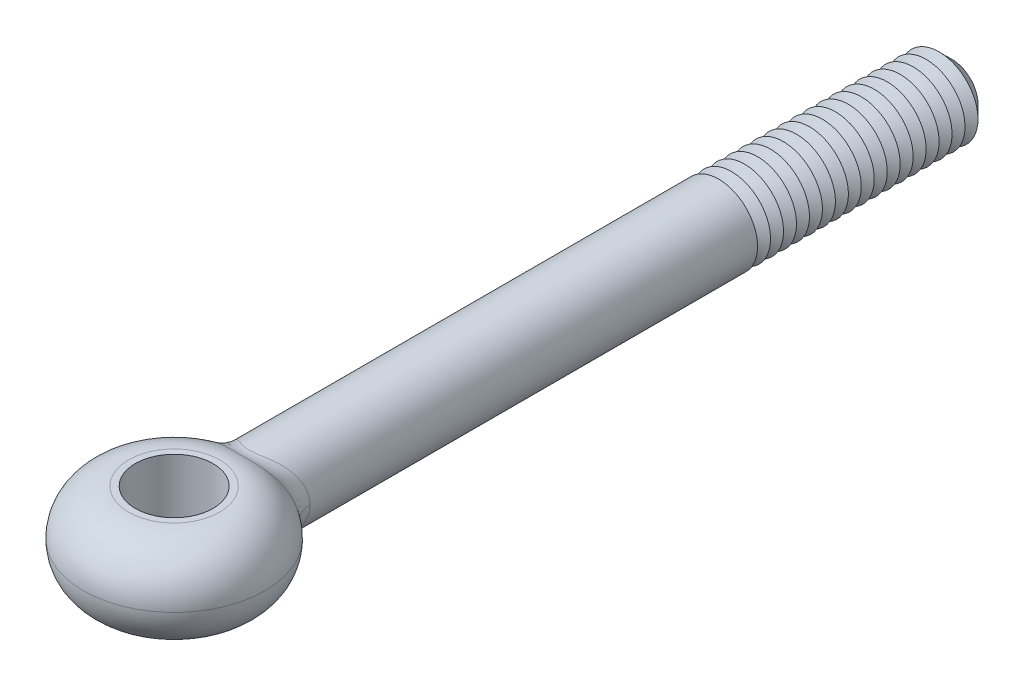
ISO-10303-21;
HEADER;
FILE_DESCRIPTION(('STEP AP214'),'2;1');
FILE_NAME('part.step','',(''),(''),'','','');
FILE_SCHEMA(('AUTOMOTIVE_DESIGN { 1 0 10303 214 1 1 1 1 }'));
ENDSEC;
DATA;
#1=APPLICATION_CONTEXT('core data for automotive mechanical design processes');
#2=APPLICATION_PROTOCOL_DEFINITION('international standard','automotive_design',2000,#1);
#3=PRODUCT_CONTEXT('',#1,'mechanical');
#4=PRODUCT('Part','Part','',(#3));
#5=PRODUCT_RELATED_PRODUCT_CATEGORY('part','',(#4));
#6=PRODUCT_DEFINITION_FORMATION('','',#4);
#7=PRODUCT_DEFINITION_CONTEXT('part definition',#1,'design');
#8=PRODUCT_DEFINITION('design','',#6,#7);
#9=PRODUCT_DEFINITION_SHAPE('','',#8);
#10=(LENGTH_UNIT() NAMED_UNIT(*) SI_UNIT(.MILLI.,.METRE.));
#11=(NAMED_UNIT(*) PLANE_ANGLE_UNIT() SI_UNIT($,.RADIAN.));
#12=(NAMED_UNIT(*) SI_UNIT($,.STERADIAN.) SOLID_ANGLE_UNIT());
#13=UNCERTAINTY_MEASURE_WITH_UNIT(LENGTH_MEASURE(1.E-05),#10,'distance_accuracy_value','');
#14=(GEOMETRIC_REPRESENTATION_CONTEXT(3) GLOBAL_UNCERTAINTY_ASSIGNED_CONTEXT((#13)) GLOBAL_UNIT_ASSIGNED_CONTEXT((#10,
#11,#12)) REPRESENTATION_CONTEXT('',''));
#15=CARTESIAN_POINT('',(0.,0.,0.));
#16=DIRECTION('',(0.,0.,1.));
#17=DIRECTION('',(1.,0.,0.));
#18=AXIS2_PLACEMENT_3D('',#15,#16,#17);
#19=CARTESIAN_POINT('',(0.,0.,-60.));
#20=DIRECTION('',(0.,0.,1.));
#21=DIRECTION('',(1.,0.,0.));
#22=AXIS2_PLACEMENT_3D('',#19,#20,#21);
#23=CYLINDRICAL_SURFACE('',#22,3.);
#24=CARTESIAN_POINT('',(0.,0.,-42.));
#25=DIRECTION('',(0.,0.,-1.));
#26=DIRECTION('',(-1.,0.,0.));
#27=AXIS2_PLACEMENT_3D('',#24,#25,#26);
#28=CIRCLE('',#27,3.);
#29=CARTESIAN_POINT('',(-3.,0.,-42.));
#30=VERTEX_POINT('',#29);
#31=EDGE_CURVE('E79',#30,#30,#28,.T.);
#32=ORIENTED_EDGE('',*,*,#31,.F.);
#33=EDGE_LOOP('',(#32));
#34=FACE_BOUND('',#33,.T.);
#35=CARTESIAN_POINT('',(3.20867656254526,-1.86688953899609,-5.60738897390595));
#36=CARTESIAN_POINT('',(2.56096665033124,-1.57853791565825,-6.18752111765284));
#37=CARTESIAN_POINT('',(2.42933329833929,-1.76021013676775,-7.07571927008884));
#38=CARTESIAN_POINT('',(3.2640375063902,-1.79983468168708,-5.6244390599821));
#39=CARTESIAN_POINT('',(2.59942976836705,-1.51546797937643,-6.20680511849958));
#40=CARTESIAN_POINT('',(2.47515209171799,-1.69698698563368,-7.10859962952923));
#41=CARTESIAN_POINT('',(3.31639317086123,-1.73064721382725,-5.64064739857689));
#42=CARTESIAN_POINT('',(2.6351235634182,-1.45163102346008,-6.22483857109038));
#43=CARTESIAN_POINT('',(2.51864422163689,-1.63175308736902,-7.13979554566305));
#44=CARTESIAN_POINT('',(3.41480339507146,-1.58839610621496,-5.67122752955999));
#45=CARTESIAN_POINT('',(2.70133077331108,-1.32242780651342,-6.2584928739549));
#46=CARTESIAN_POINT('',(2.60062893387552,-1.49763061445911,-7.19856096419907));
#47=CARTESIAN_POINT('',(3.46085609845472,-1.51533133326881,-5.68559878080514));
#48=CARTESIAN_POINT('',(2.73180651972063,-1.25708225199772,-6.27409557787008));
#49=CARTESIAN_POINT('',(2.63912004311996,-1.42874097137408,-7.22612939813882));
#50=CARTESIAN_POINT('',(3.546356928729,-1.3657196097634,-5.71234772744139));
#51=CARTESIAN_POINT('',(2.78768215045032,-1.12523153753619,-6.30284909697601));
#52=CARTESIAN_POINT('',(2.71074587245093,-1.28767848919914,-7.27737465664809));
#53=CARTESIAN_POINT('',(3.58580195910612,-1.28917104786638,-5.72472448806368));
#54=CARTESIAN_POINT('',(2.81304620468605,-1.05875480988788,-6.31598215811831));
#55=CARTESIAN_POINT('',(2.74387808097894,-1.21550413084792,-7.30104965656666));
#56=CARTESIAN_POINT('',(3.65776513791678,-1.13315402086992,-5.74734510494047));
#57=CARTESIAN_POINT('',(2.85880293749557,-0.925006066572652,-6.33977838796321));
#58=CARTESIAN_POINT('',(2.80443437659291,-1.06840236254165,-7.3442730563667));
#59=CARTESIAN_POINT('',(3.69028421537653,-1.05368594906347,-5.75758924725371));
#60=CARTESIAN_POINT('',(2.87916694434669,-0.857769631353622,-6.35042700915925));
#61=CARTESIAN_POINT('',(2.8318592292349,-0.993475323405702,-7.36382200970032));
#62=CARTESIAN_POINT('',(3.77515525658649,-0.816961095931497,-5.78435527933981));
#63=CARTESIAN_POINT('',(2.93190738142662,-0.65942955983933,-6.37810010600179));
#64=CARTESIAN_POINT('',(2.90352890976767,-0.770277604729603,-7.41485863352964));
#65=CARTESIAN_POINT('',(3.81771867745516,-0.656277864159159,-5.79782156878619));
#66=CARTESIAN_POINT('',(2.95751731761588,-0.527948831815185,-6.39167488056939));
#67=CARTESIAN_POINT('',(2.93960625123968,-0.618776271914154,-7.44047691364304));
#68=CARTESIAN_POINT('',(3.87457638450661,-0.330399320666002,-5.81581906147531));
#69=CARTESIAN_POINT('',(2.99160360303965,-0.264144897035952,-6.40978099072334));
#70=CARTESIAN_POINT('',(2.98783417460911,-0.311519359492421,-7.47469955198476));
#71=CARTESIAN_POINT('',(3.88889240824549,-0.165207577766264,-5.82035713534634));
#72=CARTESIAN_POINT('',(3.00000126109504,-0.132171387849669,-6.41427063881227));
#73=CARTESIAN_POINT('',(3.0000031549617,-0.155767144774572,-7.48331699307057));
#74=CARTESIAN_POINT('',(3.88888530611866,0.168184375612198,-5.82035471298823));
#75=CARTESIAN_POINT('',(2.99999871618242,0.134552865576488,-6.41426895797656));
#76=CARTESIAN_POINT('',(2.99999678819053,0.158573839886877,-7.48331251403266));
#77=CARTESIAN_POINT('',(3.87404149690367,0.336385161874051,-5.81564916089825));
#78=CARTESIAN_POINT('',(2.99129334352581,0.268928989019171,-6.40961447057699));
#79=CARTESIAN_POINT('',(2.98737884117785,0.317163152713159,-7.4743771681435));
#80=CARTESIAN_POINT('',(3.81515698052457,0.667880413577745,-5.79701135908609));
#81=CARTESIAN_POINT('',(2.9559743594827,0.537385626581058,-6.39085708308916));
#82=CARTESIAN_POINT('',(2.9374350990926,0.62971581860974,-7.4389355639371));
#83=CARTESIAN_POINT('',(3.77110419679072,0.831172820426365,-5.78307529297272));
#84=CARTESIAN_POINT('',(2.92945190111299,0.67109871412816,-6.37680244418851));
#85=CARTESIAN_POINT('',(2.90009908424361,0.783677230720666,-7.41242203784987));
#86=CARTESIAN_POINT('',(3.65533406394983,1.14793503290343,-5.74656955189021));
#87=CARTESIAN_POINT('',(2.85749109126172,0.936601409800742,-6.33906369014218));
#88=CARTESIAN_POINT('',(2.80235516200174,1.08233874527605,-7.34280559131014));
#89=CARTESIAN_POINT('',(3.58366301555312,1.30142077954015,-5.7240143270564));
#90=CARTESIAN_POINT('',(2.81227210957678,1.0680825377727,-6.31549258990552));
#91=CARTESIAN_POINT('',(2.74198587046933,1.22705387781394,-7.29973043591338));
#92=CARTESIAN_POINT('',(3.41475253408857,1.59497155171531,-5.67118021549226));
#93=CARTESIAN_POINT('',(2.70177181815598,1.32703977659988,-6.25865078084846));
#94=CARTESIAN_POINT('',(2.60051087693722,1.50383032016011,-7.19850118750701));
#95=CARTESIAN_POINT('',(3.31751497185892,1.73503755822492,-5.64090189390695));
#96=CARTESIAN_POINT('',(2.6367465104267,1.454297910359,-6.22550711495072));
#97=CARTESIAN_POINT('',(2.51940669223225,1.63589255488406,-7.14034819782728));
#98=CARTESIAN_POINT('',(3.09637392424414,2.00293825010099,-5.57280936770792));
#99=CARTESIAN_POINT('',(2.48348634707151,1.70556577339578,-6.14868274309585));
#100=CARTESIAN_POINT('',(2.33639294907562,1.88848463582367,-7.00903326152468));
#101=CARTESIAN_POINT('',(2.97172019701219,2.13024172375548,-5.53478597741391));
#102=CARTESIAN_POINT('',(2.3948646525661,1.82927288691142,-6.10483301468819));
#103=CARTESIAN_POINT('',(2.23390334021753,2.00851362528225,-6.93545250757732));
#104=CARTESIAN_POINT('',(2.69996830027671,2.3651018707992,-5.45362314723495));
#105=CARTESIAN_POINT('',(2.19516623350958,2.06511554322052,-6.0083348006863));
#106=CARTESIAN_POINT('',(2.01290711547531,2.22995319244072,-6.77759807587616));
#107=CARTESIAN_POINT('',(2.55285883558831,2.47264854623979,-5.41048113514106));
#108=CARTESIAN_POINT('',(2.08437280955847,2.17728215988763,-5.95580351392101));
#109=CARTESIAN_POINT('',(1.89439244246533,2.33135434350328,-6.69331902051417));
#110=CARTESIAN_POINT('',(2.30998722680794,2.62203371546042,-5.3420402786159));
#111=CARTESIAN_POINT('',(1.89619405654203,2.33829445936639,-5.87000214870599));
#112=CARTESIAN_POINT('',(1.70155283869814,2.47220321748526,-6.55887884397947));
#113=CARTESIAN_POINT('',(2.22150305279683,2.67143197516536,-5.3176024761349));
#114=CARTESIAN_POINT('',(1.82698546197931,2.39247654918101,-5.83902999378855));
#115=CARTESIAN_POINT('',(1.6318003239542,2.51877871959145,-6.51073776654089));
#116=CARTESIAN_POINT('',(2.03843806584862,2.76380875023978,-5.26856885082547));
#117=CARTESIAN_POINT('',(1.68220937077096,2.4954877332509,-5.77608718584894));
#118=CARTESIAN_POINT('',(1.48876141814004,2.60587682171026,-6.41385450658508));
#119=CARTESIAN_POINT('',(1.94385887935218,2.80678896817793,-5.24397307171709));
#120=CARTESIAN_POINT('',(1.60666598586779,2.54435586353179,-5.74411696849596));
#121=CARTESIAN_POINT('',(1.41547597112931,2.64640102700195,-6.36511248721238));
#122=CARTESIAN_POINT('',(1.74840195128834,2.88622799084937,-5.19533539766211));
#123=CARTESIAN_POINT('',(1.44916682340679,2.63609614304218,-5.68016772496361));
#124=CARTESIAN_POINT('',(1.26552728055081,2.72130067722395,-6.26843880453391));
#125=CARTESIAN_POINT('',(1.64751683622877,2.92267896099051,-5.17129419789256));
#126=CARTESIAN_POINT('',(1.36720978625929,2.67900755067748,-5.64817791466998));
#127=CARTESIAN_POINT('',(1.18886011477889,2.75566873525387,-6.22050817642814));
#128=CARTESIAN_POINT('',(1.43932773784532,2.9888232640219,-5.12481803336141));
#129=CARTESIAN_POINT('',(1.19698367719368,2.75798926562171,-5.58572642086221));
#130=CARTESIAN_POINT('',(1.03236587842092,2.81803336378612,-6.12758795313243));
#131=CARTESIAN_POINT('',(1.33202619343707,3.01851914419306,-5.10238246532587));
#132=CARTESIAN_POINT('',(1.10870348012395,2.79411419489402,-5.55524119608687));
#133=CARTESIAN_POINT('',(0.952540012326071,2.84603233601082,-6.08259725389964));
#134=CARTESIAN_POINT('',(1.14714488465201,3.0622946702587,-5.06741366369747));
#135=CARTESIAN_POINT('',(0.955864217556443,2.84805312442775,-5.50733016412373));
#136=CARTESIAN_POINT('',(0.81652988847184,2.88730640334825,-6.01230192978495));
#137=CARTESIAN_POINT('',(1.0713798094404,3.07829978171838,-5.05404848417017));
#138=CARTESIAN_POINT('',(0.893090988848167,2.86798092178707,-5.48891166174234));
#139=CARTESIAN_POINT('',(0.761192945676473,2.90239693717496,-5.98538526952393));
#140=CARTESIAN_POINT('',(0.916863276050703,3.10704015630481,-5.02923110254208));
#141=CARTESIAN_POINT('',(0.764832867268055,2.90402976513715,-5.45456574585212));
#142=CARTESIAN_POINT('',(0.649139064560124,2.92949500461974,-5.93533347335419));
#143=CARTESIAN_POINT('',(0.838111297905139,3.1197748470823,-5.01777923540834));
#144=CARTESIAN_POINT('',(0.69932722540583,2.92016650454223,-5.43862583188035));
#145=CARTESIAN_POINT('',(0.592421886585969,2.94150199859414,-5.91219899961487));
#146=CARTESIAN_POINT('',(0.6782293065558,3.14177269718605,-4.99746218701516));
#147=CARTESIAN_POINT('',(0.56619562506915,2.94820006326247,-5.41026040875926));
#148=CARTESIAN_POINT('',(0.477997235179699,2.96224282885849,-5.87111000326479));
#149=CARTESIAN_POINT('',(0.597112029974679,3.15105169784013,-4.98858524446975));
#150=CARTESIAN_POINT('',(0.49855284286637,2.96013078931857,-5.39780561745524));
#151=CARTESIAN_POINT('',(0.42029558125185,2.970991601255,-5.85313193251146));
#152=CARTESIAN_POINT('',(0.432732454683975,3.16605777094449,-4.9739751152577));
#153=CARTESIAN_POINT('',(0.361419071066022,2.97949280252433,-5.377273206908));
#154=CARTESIAN_POINT('',(0.303924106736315,2.98514018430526,-5.82352161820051));
#155=CARTESIAN_POINT('',(0.34947150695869,3.17178702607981,-4.96823999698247));
#156=CARTESIAN_POINT('',(0.291891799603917,2.98693839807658,-5.36918117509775));
#157=CARTESIAN_POINT('',(0.245254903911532,2.9905420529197,-5.81188547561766));
#158=CARTESIAN_POINT('',(0.180705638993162,3.17961288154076,-4.96035475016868));
#159=CARTESIAN_POINT('',(0.150966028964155,2.99711750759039,-5.35805376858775));
#160=CARTESIAN_POINT('',(0.126651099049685,2.99792071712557,-5.79588271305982));
#161=CARTESIAN_POINT('',(0.0951859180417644,3.18166687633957,-4.95824667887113));
#162=CARTESIAN_POINT('',(0.0795084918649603,2.99980259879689,-5.35507030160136));
#163=CARTESIAN_POINT('',(0.0667097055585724,2.99985734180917,-5.79160137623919));
#164=CARTESIAN_POINT('',(-0.0758990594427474,3.18195333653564,-4.95795434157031));
#165=CARTESIAN_POINT('',(-0.0633965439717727,3.00017632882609,-5.35465714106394));
#166=CARTESIAN_POINT('',(-0.0531929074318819,3.00012743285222,-5.79100779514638));
#167=CARTESIAN_POINT('',(-0.161464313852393,3.18018596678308,-4.95976990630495));
#168=CARTESIAN_POINT('',(-0.134893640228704,2.99786544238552,-5.35722692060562));
#169=CARTESIAN_POINT('',(-0.113154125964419,2.99846105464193,-5.79469520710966));
#170=CARTESIAN_POINT('',(-0.331649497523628,3.17286894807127,-4.96715548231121));
#171=CARTESIAN_POINT('',(-0.277011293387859,2.98834413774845,-5.36765144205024));
#172=CARTESIAN_POINT('',(-0.232710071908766,2.99156215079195,-5.80968494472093));
#173=CARTESIAN_POINT('',(-0.416265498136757,3.16730714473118,-4.97273755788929));
#174=CARTESIAN_POINT('',(-0.347675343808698,2.98111153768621,-5.37553016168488));
#175=CARTESIAN_POINT('',(-0.292302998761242,2.98631816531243,-5.82101173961));
#176=CARTESIAN_POINT('',(-0.583319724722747,3.15252271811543,-4.98717042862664));
#177=CARTESIAN_POINT('',(-0.487052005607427,2.96202363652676,-5.3958201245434));
#178=CARTESIAN_POINT('',(-0.410500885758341,2.97237856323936,-5.85026594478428));
#179=CARTESIAN_POINT('',(-0.665756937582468,3.1432984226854,-4.99602271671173));
#180=CARTESIAN_POINT('',(-0.555803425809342,2.9501544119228,-5.40824549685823));
#181=CARTESIAN_POINT('',(-0.469105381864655,2.96368137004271,-5.86819636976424));
#182=CARTESIAN_POINT('',(-0.852542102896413,3.11800936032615,-5.01944463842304));
#183=CARTESIAN_POINT('',(-0.711397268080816,2.91789597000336,-5.44096622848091));
#184=CARTESIAN_POINT('',(-0.602710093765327,2.9398373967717,-5.91556991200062));
#185=CARTESIAN_POINT('',(-0.955914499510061,3.10071678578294,-5.03493446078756));
#186=CARTESIAN_POINT('',(-0.797372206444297,2.89599454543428,-5.46252153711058));
#187=CARTESIAN_POINT('',(-0.677266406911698,2.92353296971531,-5.9468562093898));
#188=CARTESIAN_POINT('',(-1.15747034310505,3.06050331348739,-5.06896237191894));
#189=CARTESIAN_POINT('',(-0.96448946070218,2.84579648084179,-5.50948574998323));
#190=CARTESIAN_POINT('',(-0.82399035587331,2.88561741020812,-6.01542593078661));
#191=CARTESIAN_POINT('',(-1.25565167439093,3.03758014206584,-5.08750169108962));
#192=CARTESIAN_POINT('',(-1.04567094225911,2.81745945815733,-5.53492466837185));
#193=CARTESIAN_POINT('',(-0.896157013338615,2.8640041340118,-6.05271177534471));
#194=CARTESIAN_POINT('',(-1.44701488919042,2.98629407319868,-5.12649976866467));
#195=CARTESIAN_POINT('',(-1.20319716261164,2.75504714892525,-5.58794679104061));
#196=CARTESIAN_POINT('',(-1.03815002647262,2.8156486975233,-6.130943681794));
#197=CARTESIAN_POINT('',(-1.54018815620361,2.95792216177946,-5.1469616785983));
#198=CARTESIAN_POINT('',(-1.27955391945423,2.72092467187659,-5.61555495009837));
#199=CARTESIAN_POINT('',(-1.10797227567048,2.78889803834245,-6.17189574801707));
#200=CARTESIAN_POINT('',(-1.72151711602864,2.89592293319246,-5.18889273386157));
#201=CARTESIAN_POINT('',(-1.42727129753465,2.64757180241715,-5.67156834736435));
#202=CARTESIAN_POINT('',(-1.24508737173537,2.73044162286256,-6.25559228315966));
#203=CARTESIAN_POINT('',(-1.80967353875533,2.86229638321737,-5.21036173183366));
#204=CARTESIAN_POINT('',(-1.49863783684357,2.60830676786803,-5.69998707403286));
#205=CARTESIAN_POINT('',(-1.31238058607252,2.69873658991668,-6.29833648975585));
#206=CARTESIAN_POINT('',(-1.98571143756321,2.78796010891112,-5.25480393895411));
#207=CARTESIAN_POINT('',(-1.64009897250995,2.52294667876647,-5.75819924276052));
#208=CARTESIAN_POINT('',(-1.44787080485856,2.62864810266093,-6.38658240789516));
#209=CARTESIAN_POINT('',(-2.07332759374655,2.746968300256,-5.27779631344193));
#210=CARTESIAN_POINT('',(-1.70989675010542,2.47657447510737,-5.78798453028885));
#211=CARTESIAN_POINT('',(-1.51592466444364,2.58999868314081,-6.43210962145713));
#212=CARTESIAN_POINT('',(-2.2432391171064,2.65939261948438,-5.32358826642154));
#213=CARTESIAN_POINT('',(-1.84397839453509,2.37927832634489,-5.846613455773));
#214=CARTESIAN_POINT('',(-1.64892099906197,2.50742732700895,-6.52253244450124));
#215=CARTESIAN_POINT('',(-2.32553297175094,2.61280716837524,-5.34638778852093));
#216=CARTESIAN_POINT('',(-1.90824127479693,2.32832315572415,-5.87545589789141));
#217=CARTESIAN_POINT('',(-1.71386258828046,2.46350390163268,-6.56742787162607));
#218=CARTESIAN_POINT('',(-2.5641633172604,2.46496130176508,-5.41374113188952));
#219=CARTESIAN_POINT('',(-2.09300733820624,2.16915106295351,-5.95982947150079));
#220=CARTESIAN_POINT('',(-1.90344199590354,2.32410637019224,-6.69970299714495));
#221=CARTESIAN_POINT('',(-2.71256686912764,2.35547619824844,-5.4573335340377));
#222=CARTESIAN_POINT('',(-2.20461350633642,2.05516387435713,-6.01283232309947));
#223=CARTESIAN_POINT('',(-2.02308115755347,2.2208775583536,-6.78483780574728));
#224=CARTESIAN_POINT('',(-3.00301596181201,2.10163957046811,-5.54419617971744));
#225=CARTESIAN_POINT('',(-2.41778154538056,1.80070495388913,-6.11598887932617));
#226=CARTESIAN_POINT('',(-2.25944200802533,1.98154588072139,-6.95372540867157));
#227=CARTESIAN_POINT('',(-3.1420990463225,1.95466818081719,-5.58678396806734));
#228=CARTESIAN_POINT('',(-2.51591581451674,1.65883259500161,-6.16477103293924));
#229=CARTESIAN_POINT('',(-2.37404369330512,1.84297285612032,-7.03605392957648));
#230=CARTESIAN_POINT('',(-3.38785298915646,1.63858571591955,-5.66272580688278));
#231=CARTESIAN_POINT('',(-2.68453053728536,1.36565972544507,-6.24972770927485));
#232=CARTESIAN_POINT('',(-2.57792192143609,1.54495224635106,-7.18232146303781));
#233=CARTESIAN_POINT('',(-3.49450592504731,1.46946247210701,-5.69607475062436));
#234=CARTESIAN_POINT('',(-2.75453740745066,1.21455209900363,-6.28567815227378));
#235=CARTESIAN_POINT('',(-2.66718445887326,1.38549318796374,-7.24625030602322));
#236=CARTESIAN_POINT('',(-3.66380219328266,1.1299583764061,-5.74921606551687));
#237=CARTESIAN_POINT('',(-2.86316402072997,0.920881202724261,-6.3419757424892));
#238=CARTESIAN_POINT('',(-2.8094401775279,1.06538932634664,-7.34787971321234));
#239=CARTESIAN_POINT('',(-3.72945621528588,0.960953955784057,-5.76993212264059));
#240=CARTESIAN_POINT('',(-2.90370657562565,0.778947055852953,-6.36326874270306));
#241=CARTESIAN_POINT('',(-2.86490429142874,0.906042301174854,-7.38737179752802));
#242=CARTESIAN_POINT('',(-3.82803878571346,0.614436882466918,-5.80107948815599));
#243=CARTESIAN_POINT('',(-2.96393533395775,0.493368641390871,-6.39505004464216));
#244=CARTESIAN_POINT('',(-2.94832898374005,0.5793262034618,-7.44668580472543));
#245=CARTESIAN_POINT('',(-3.86106115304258,0.436950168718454,-5.81154028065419));
#246=CARTESIAN_POINT('',(-2.98349655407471,0.350141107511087,-6.40547274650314));
#247=CARTESIAN_POINT('',(-2.97636840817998,0.411981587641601,-7.46656411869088));
#248=CARTESIAN_POINT('',(-3.88111578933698,0.215363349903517,-5.81789329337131));
#249=CARTESIAN_POINT('',(-2.99539251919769,0.172394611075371,-6.41181290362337));
#250=CARTESIAN_POINT('',(-2.99339822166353,0.203056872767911,-7.47863586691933));
#251=CARTESIAN_POINT('',(-3.88402884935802,0.172339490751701,-5.81881611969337));
#252=CARTESIAN_POINT('',(-2.99712106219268,0.137923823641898,-6.41273432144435));
#253=CARTESIAN_POINT('',(-2.99587203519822,0.16249151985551,-7.48038932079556));
#254=CARTESIAN_POINT('',(-3.88791595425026,0.0862156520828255,-5.82004764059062));
#255=CARTESIAN_POINT('',(-2.99942439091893,0.0689697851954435,-6.41396268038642));
#256=CARTESIAN_POINT('',(-2.99917350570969,0.0812890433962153,-7.48272910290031));
#257=CARTESIAN_POINT('',(-3.88889040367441,0.0431156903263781,-5.82035646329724));
#258=CARTESIAN_POINT('',(-2.99999898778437,0.0344929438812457,-6.41426952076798));
#259=CARTESIAN_POINT('',(-3.00000150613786,0.0406519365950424,-7.48331567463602));
#260=CARTESIAN_POINT('',(-3.88888299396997,-0.167788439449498,-5.82035387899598));
#261=CARTESIAN_POINT('',(-3.00000393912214,-0.134232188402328,-6.41427091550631));
#262=CARTESIAN_POINT('',(-2.9999941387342,-0.15820052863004,-7.48331126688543));
#263=CARTESIAN_POINT('',(-3.87409666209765,-0.335815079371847,-5.81566687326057));
#264=CARTESIAN_POINT('',(-2.99132704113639,-0.268467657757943,-6.40963250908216));
#265=CARTESIAN_POINT('',(-2.98742586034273,-0.316625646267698,-7.47441080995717));
#266=CARTESIAN_POINT('',(-3.81528095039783,-0.667441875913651,-5.79705034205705));
#267=CARTESIAN_POINT('',(-2.95604795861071,-0.537030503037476,-6.39089602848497));
#268=CARTESIAN_POINT('',(-2.93754001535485,-0.629302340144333,-7.43900973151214));
#269=CARTESIAN_POINT('',(-3.77115080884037,-0.831024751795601,-5.78308897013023));
#270=CARTESIAN_POINT('',(-2.92948278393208,-0.670988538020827,-6.3768176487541));
#271=CARTESIAN_POINT('',(-2.90013717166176,-0.783537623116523,-7.41244846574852));
#272=CARTESIAN_POINT('',(-3.68420709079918,-1.06894491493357,-5.75567457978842));
#273=CARTESIAN_POINT('',(-2.87536500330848,-0.870652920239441,-6.34843788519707));
#274=CARTESIAN_POINT('',(-2.82673309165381,-1.00786234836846,-7.36016870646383));
#275=CARTESIAN_POINT('',(-3.65178721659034,-1.14697548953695,-5.74546383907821));
#276=CARTESIAN_POINT('',(-2.85503050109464,-0.936773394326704,-6.33781082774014));
#277=CARTESIAN_POINT('',(-2.79939811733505,-1.08143403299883,-7.34068082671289));
#278=CARTESIAN_POINT('',(-3.58025604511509,-1.30018288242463,-5.72298379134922));
#279=CARTESIAN_POINT('',(-2.80948516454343,-1.06829583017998,-6.31413687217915));
#280=CARTESIAN_POINT('',(-2.73921822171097,-1.22588671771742,-7.29772059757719));
#281=CARTESIAN_POINT('',(-3.54114381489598,-1.37535930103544,-5.71071419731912));
#282=CARTESIAN_POINT('',(-2.78430184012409,-1.13366420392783,-6.30110391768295));
#283=CARTESIAN_POINT('',(-2.70637253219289,-1.29676734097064,-7.27424769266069));
#284=CARTESIAN_POINT('',(-3.45663845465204,-1.52213332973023,-5.68428226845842));
#285=CARTESIAN_POINT('',(-2.72901827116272,-1.26315433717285,-6.27266712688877));
#286=CARTESIAN_POINT('',(-2.63559380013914,-1.43515428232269,-7.22360441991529));
#287=CARTESIAN_POINT('',(-3.41126467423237,-1.59374107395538,-5.67012576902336));
#288=CARTESIAN_POINT('',(-2.69896514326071,-1.32725151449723,-6.25728646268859));
#289=CARTESIAN_POINT('',(-2.59767644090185,-1.50267015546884,-7.19644544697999));
#290=CARTESIAN_POINT('',(-3.31444986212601,-1.73321286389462,-5.64004567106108));
#291=CARTESIAN_POINT('',(-2.63379544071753,-1.4540048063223,-6.22416747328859));
#292=CARTESIAN_POINT('',(-2.51702985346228,-1.63417212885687,-7.13863740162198));
#293=CARTESIAN_POINT('',(-3.26301063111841,-1.80107801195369,-5.62412259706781));
#294=CARTESIAN_POINT('',(-2.59871455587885,-1.51664149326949,-6.20644633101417));
#295=CARTESIAN_POINT('',(-2.47430205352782,-1.69815926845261,-7.10798936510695));
#296=CARTESIAN_POINT('',(-3.20867656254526,-1.86688953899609,-5.60738897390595));
#297=CARTESIAN_POINT('',(-2.56096665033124,-1.57853791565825,-6.18752111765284));
#298=CARTESIAN_POINT('',(-2.42933329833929,-1.76021013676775,-7.07571927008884));
#299=(BOUNDED_SURFACE() B_SPLINE_SURFACE(3,2,((#35,#36,#37),(#38,#39,#40),(#41,#42,#43),(#44,
#45,#46),(#47,#48,#49),(#50,#51,#52),(#53,#54,#55),(#56,#57,#58),(#59,#60,#61),(#62,#63,#64),
(#65,#66,#67),(#68,#69,#70),(#71,#72,#73),(#74,#75,#76),(#77,#78,#79),(#80,#81,#82),(#83,#84,
#85),(#86,#87,#88),(#89,#90,#91),(#92,#93,#94),(#95,#96,#97),(#98,#99,#100),(#101,#102,#103),
(#104,#105,#106),(#107,#108,#109),(#110,#111,#112),(#113,#114,#115),(#116,#117,#118),(#119,#120,
#121),(#122,#123,#124),(#125,#126,#127),(#128,#129,#130),(#131,#132,#133),(#134,#135,#136),
(#137,#138,#139),(#140,#141,#142),(#143,#144,#145),(#146,#147,#148),(#149,#150,#151),(#152,#153,
#154),(#155,#156,#157),(#158,#159,#160),(#161,#162,#163),(#164,#165,#166),(#167,#168,#169),
(#170,#171,#172),(#173,#174,#175),(#176,#177,#178),(#179,#180,#181),(#182,#183,#184),(#185,#186,
#187),(#188,#189,#190),(#191,#192,#193),(#194,#195,#196),(#197,#198,#199),(#200,#201,#202),
(#203,#204,#205),(#206,#207,#208),(#209,#210,#211),(#212,#213,#214),(#215,#216,#217),(#218,#219,
#220),(#221,#222,#223),(#224,#225,#226),(#227,#228,#229),(#230,#231,#232),(#233,#234,#235),
(#236,#237,#238),(#239,#240,#241),(#242,#243,#244),(#245,#246,#247),(#248,#249,#250),(#251,#252,
#253),(#254,#255,#256),(#257,#258,#259),(#260,#261,#262),(#263,#264,#265),(#266,#267,#268),
(#269,#270,#271),(#272,#273,#274),(#275,#276,#277),(#278,#279,#280),(#281,#282,#283),(#284,#285,
#286),(#287,#288,#289),(#290,#291,#292),(#293,#294,#295),(#296,#297,#298)),.UNSPECIFIED.,.F.,
.F.,.F.) B_SPLINE_SURFACE_WITH_KNOTS((4,2,2,2,2,2,2,2,2,2,2,2,2,2,2,2,2,2,2,2,2,2,2,2,2,2,2,2,2,
2,2,2,2,2,2,2,2,2,2,2,2,2,2,4),(3,3),(0.,0.402578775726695,0.805275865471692,1.20816114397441,
1.61099234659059,2.38951834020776,3.16744499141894,3.95938873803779,4.75166012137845,
5.54260903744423,6.33350009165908,7.14956449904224,7.96604074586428,8.40919064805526,
8.8522227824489,9.29578301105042,9.7391756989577,10.0369232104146,10.334722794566,
10.6311399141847,10.9273745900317,11.2270216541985,11.5266557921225,11.8272542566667,
12.1279901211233,12.5203401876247,12.9128489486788,13.3060127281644,13.6991191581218,
14.1131872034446,14.5273724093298,15.3542822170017,16.2816457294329,17.2095208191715,
18.0570670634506,18.9021693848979,19.1054047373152,19.3085976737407,20.0993405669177,
20.8928128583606,21.2891887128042,21.6856198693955,22.0808523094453,22.4759677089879),(0.,1.),
.UNSPECIFIED.) GEOMETRIC_REPRESENTATION_ITEM() RATIONAL_B_SPLINE_SURFACE(((1.,0.909163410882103,
1.),(1.,0.907082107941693,1.),(1.,0.905079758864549,1.),(1.,0.901265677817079,1.),(1.,
0.899454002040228,1.),(1.,0.896054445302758,1.),(1.,0.894466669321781,1.),(1.,0.8915452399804,
1.),(1.,0.890211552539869,1.),(1.,0.8867092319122,1.),(1.,0.884921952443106,1.),(1.,
0.882526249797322,1.),(1.,0.881916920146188,1.),(1.,0.881917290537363,1.),(1.,0.882549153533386,
1.),(1.,0.885029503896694,1.),(1.,0.88687849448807,1.),(1.,0.891651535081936,1.),(1.,
0.894573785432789,1.),(1.,0.901284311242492,1.),(1.,0.905072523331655,1.),(1.,0.913384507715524,
1.),(1.,0.917927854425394,1.),(1.,0.927337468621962,1.),(1.,0.932203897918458,1.),(1.,
0.93966862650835,1.),(1.,0.942286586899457,1.),(1.,0.947441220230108,1.),(1.,0.949977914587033,
1.),(1.,0.954897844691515,1.),(1.,0.957280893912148,1.),(1.,0.961800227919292,1.),(1.,
0.963936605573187,1.),(1.,0.967208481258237,1.),(1.,0.968442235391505,1.),(1.,0.970708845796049,
1.),(1.,0.97174166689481,1.),(1.,0.973558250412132,1.),(1.,0.974343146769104,1.),(1.,
0.975627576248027,1.),(1.,0.976127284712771,1.),(1.,0.976812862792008,1.),(1.,0.976995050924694,
1.),(1.,0.977020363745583,1.),(1.,0.976863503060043,1.),(1.,0.976221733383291,1.),(1.,
0.975735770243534,1.),(1.,0.974468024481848,1.),(1.,0.973686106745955,1.),(1.,0.971593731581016,
1.),(1.,0.970194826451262,1.),(1.,0.967067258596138,1.),(1.,0.965338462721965,1.),(1.,
0.961634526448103,1.),(1.,0.959658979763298,1.),(1.,0.955535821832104,1.),(1.,0.95338823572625,
1.),(1.,0.948862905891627,1.),(1.,0.946478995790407,1.),(1.,0.941646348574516,1.),(1.,
0.939197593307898,1.),(1.,0.931841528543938,1.),(1.,0.926915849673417,1.),(1.,0.916826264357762,
1.),(1.,0.911706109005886,1.),(1.,0.902364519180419,1.),(1.,0.898143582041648,1.),(1.,
0.891316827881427,1.),(1.,0.888602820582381,1.),(1.,0.884494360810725,1.),(1.,0.883096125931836,
1.),(1.,0.882246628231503,1.),(1.,0.882123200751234,1.),(1.,0.881958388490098,1.),(1.,
0.881916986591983,1.),(1.,0.881917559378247,1.),(1.,0.88254679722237,1.),(1.,0.885024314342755,
1.),(1.,0.886876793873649,1.),(1.,0.890461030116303,1.),(1.,0.89178924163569,1.),(1.,
0.894690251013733,1.),(1.,0.896263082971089,1.),(1.,0.899620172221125,1.),(1.,0.90140377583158,
1.),(1.,0.905154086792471,1.),(1.,0.907120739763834,1.),(1.,0.909163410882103,1.))) REPRESENTATION_ITEM('') SURFACE());
#300=CARTESIAN_POINT('',(-2.42933329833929,-1.76021013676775,-7.07571927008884));
#301=CARTESIAN_POINT('',(-2.47430205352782,-1.69815926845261,-7.10798936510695));
#302=CARTESIAN_POINT('',(-2.51702985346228,-1.63417212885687,-7.13863740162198));
#303=CARTESIAN_POINT('',(-2.59767644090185,-1.50267015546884,-7.19644544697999));
#304=CARTESIAN_POINT('',(-2.63559380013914,-1.43515428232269,-7.22360441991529));
#305=CARTESIAN_POINT('',(-2.70637253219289,-1.29676734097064,-7.27424769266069));
#306=CARTESIAN_POINT('',(-2.73921822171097,-1.22588671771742,-7.29772059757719));
#307=CARTESIAN_POINT('',(-2.79939811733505,-1.08143403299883,-7.34068082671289));
#308=CARTESIAN_POINT('',(-2.82673309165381,-1.00786234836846,-7.36016870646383));
#309=CARTESIAN_POINT('',(-2.90013717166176,-0.783537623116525,-7.41244846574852));
#310=CARTESIAN_POINT('',(-2.93754001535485,-0.629302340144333,-7.43900973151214));
#311=CARTESIAN_POINT('',(-2.98742586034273,-0.316625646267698,-7.47441080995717));
#312=CARTESIAN_POINT('',(-2.9999941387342,-0.158200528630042,-7.48331126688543));
#313=CARTESIAN_POINT('',(-3.00000150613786,0.0406519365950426,-7.48331567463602));
#314=CARTESIAN_POINT('',(-2.99917350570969,0.0812890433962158,-7.48272910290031));
#315=CARTESIAN_POINT('',(-2.99587203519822,0.162491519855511,-7.48038932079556));
#316=CARTESIAN_POINT('',(-2.99339822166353,0.203056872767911,-7.47863586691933));
#317=CARTESIAN_POINT('',(-2.97636840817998,0.411981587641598,-7.46656411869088));
#318=CARTESIAN_POINT('',(-2.94832898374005,0.579326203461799,-7.44668580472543));
#319=CARTESIAN_POINT('',(-2.86490429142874,0.906042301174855,-7.38737179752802));
#320=CARTESIAN_POINT('',(-2.8094401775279,1.06538932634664,-7.34787971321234));
#321=CARTESIAN_POINT('',(-2.66718445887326,1.38549318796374,-7.24625030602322));
#322=CARTESIAN_POINT('',(-2.57792192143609,1.54495224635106,-7.18232146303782));
#323=CARTESIAN_POINT('',(-2.37404369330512,1.84297285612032,-7.03605392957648));
#324=CARTESIAN_POINT('',(-2.25944200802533,1.98154588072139,-6.95372540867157));
#325=CARTESIAN_POINT('',(-2.02308115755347,2.2208775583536,-6.78483780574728));
#326=CARTESIAN_POINT('',(-1.90344199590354,2.32410637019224,-6.69970299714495));
#327=CARTESIAN_POINT('',(-1.71386258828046,2.46350390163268,-6.56742787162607));
#328=CARTESIAN_POINT('',(-1.64892099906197,2.50742732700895,-6.52253244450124));
#329=CARTESIAN_POINT('',(-1.51592466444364,2.58999868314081,-6.43210962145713));
#330=CARTESIAN_POINT('',(-1.44787080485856,2.62864810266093,-6.38658240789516));
#331=CARTESIAN_POINT('',(-1.31238058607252,2.69873658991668,-6.29833648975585));
#332=CARTESIAN_POINT('',(-1.24508737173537,2.73044162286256,-6.25559228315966));
#333=CARTESIAN_POINT('',(-1.10797227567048,2.78889803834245,-6.17189574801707));
#334=CARTESIAN_POINT('',(-1.03815002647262,2.8156486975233,-6.130943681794));
#335=CARTESIAN_POINT('',(-0.896157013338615,2.8640041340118,-6.05271177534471));
#336=CARTESIAN_POINT('',(-0.82399035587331,2.88561741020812,-6.01542593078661));
#337=CARTESIAN_POINT('',(-0.677266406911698,2.92353296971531,-5.9468562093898));
#338=CARTESIAN_POINT('',(-0.602710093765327,2.9398373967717,-5.91556991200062));
#339=CARTESIAN_POINT('',(-0.469105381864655,2.96368137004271,-5.86819636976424));
#340=CARTESIAN_POINT('',(-0.410500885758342,2.97237856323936,-5.85026594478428));
#341=CARTESIAN_POINT('',(-0.292302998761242,2.98631816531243,-5.82101173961));
#342=CARTESIAN_POINT('',(-0.232710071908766,2.99156215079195,-5.80968494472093));
#343=CARTESIAN_POINT('',(-0.113154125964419,2.99846105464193,-5.79469520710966));
#344=CARTESIAN_POINT('',(-0.0531929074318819,3.00012743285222,-5.79100779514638));
#345=CARTESIAN_POINT('',(0.0667097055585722,2.99985734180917,-5.79160137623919));
#346=CARTESIAN_POINT('',(0.126651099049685,2.99792071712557,-5.79588271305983));
#347=CARTESIAN_POINT('',(0.245254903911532,2.9905420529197,-5.81188547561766));
#348=CARTESIAN_POINT('',(0.303924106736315,2.98514018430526,-5.82352161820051));
#349=CARTESIAN_POINT('',(0.42029558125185,2.970991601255,-5.85313193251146));
#350=CARTESIAN_POINT('',(0.477997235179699,2.96224282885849,-5.87111000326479));
#351=CARTESIAN_POINT('',(0.592421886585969,2.94150199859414,-5.91219899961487));
#352=CARTESIAN_POINT('',(0.649139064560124,2.92949500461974,-5.93533347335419));
#353=CARTESIAN_POINT('',(0.761192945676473,2.90239693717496,-5.98538526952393));
#354=CARTESIAN_POINT('',(0.81652988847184,2.88730640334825,-6.01230192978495));
#355=CARTESIAN_POINT('',(0.952540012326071,2.84603233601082,-6.08259725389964));
#356=CARTESIAN_POINT('',(1.03236587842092,2.81803336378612,-6.12758795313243));
#357=CARTESIAN_POINT('',(1.18886011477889,2.75566873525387,-6.22050817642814));
#358=CARTESIAN_POINT('',(1.26552728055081,2.72130067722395,-6.26843880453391));
#359=CARTESIAN_POINT('',(1.41547597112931,2.64640102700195,-6.36511248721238));
#360=CARTESIAN_POINT('',(1.48876141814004,2.60587682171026,-6.41385450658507));
#361=CARTESIAN_POINT('',(1.6318003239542,2.51877871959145,-6.51073776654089));
#362=CARTESIAN_POINT('',(1.70155283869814,2.47220321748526,-6.55887884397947));
#363=CARTESIAN_POINT('',(1.89439244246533,2.33135434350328,-6.69331902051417));
#364=CARTESIAN_POINT('',(2.01290711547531,2.22995319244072,-6.77759807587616));
#365=CARTESIAN_POINT('',(2.23390334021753,2.00851362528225,-6.93545250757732));
#366=CARTESIAN_POINT('',(2.33639294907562,1.88848463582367,-7.00903326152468));
#367=CARTESIAN_POINT('',(2.51940669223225,1.63589255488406,-7.14034819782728));
#368=CARTESIAN_POINT('',(2.60051087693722,1.50383032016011,-7.19850118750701));
#369=CARTESIAN_POINT('',(2.74198587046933,1.22705387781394,-7.29973043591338));
#370=CARTESIAN_POINT('',(2.80235516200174,1.08233874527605,-7.34280559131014));
#371=CARTESIAN_POINT('',(2.90009908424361,0.783677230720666,-7.41242203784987));
#372=CARTESIAN_POINT('',(2.9374350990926,0.62971581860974,-7.4389355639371));
#373=CARTESIAN_POINT('',(2.98737884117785,0.317163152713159,-7.4743771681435));
#374=CARTESIAN_POINT('',(2.99999678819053,0.158573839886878,-7.48331251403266));
#375=CARTESIAN_POINT('',(3.0000031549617,-0.155767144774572,-7.48331699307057));
#376=CARTESIAN_POINT('',(2.98783417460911,-0.311519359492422,-7.47469955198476));
#377=CARTESIAN_POINT('',(2.93960625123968,-0.618776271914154,-7.44047691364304));
#378=CARTESIAN_POINT('',(2.90352890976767,-0.770277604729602,-7.41485863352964));
#379=CARTESIAN_POINT('',(2.8318592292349,-0.993475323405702,-7.36382200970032));
#380=CARTESIAN_POINT('',(2.80443437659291,-1.06840236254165,-7.3442730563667));
#381=CARTESIAN_POINT('',(2.74387808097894,-1.21550413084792,-7.30104965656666));
#382=CARTESIAN_POINT('',(2.71074587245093,-1.28767848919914,-7.27737465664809));
#383=CARTESIAN_POINT('',(2.63912004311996,-1.42874097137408,-7.22612939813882));
#384=CARTESIAN_POINT('',(2.60062893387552,-1.49763061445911,-7.19856096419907));
#385=CARTESIAN_POINT('',(2.51864422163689,-1.63175308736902,-7.13979554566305));
#386=CARTESIAN_POINT('',(2.47515209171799,-1.69698698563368,-7.10859962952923));
#387=CARTESIAN_POINT('',(2.42933329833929,-1.76021013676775,-7.07571927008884));
#388=B_SPLINE_CURVE_WITH_KNOTS('',3,(#300,#301,#302,#303,#304,#305,#306,#307,#308,#309,#310,
#311,#312,#313,#314,#315,#316,#317,#318,#319,#320,#321,#322,#323,#324,#325,#326,#327,#328,#329,
#330,#331,#332,#333,#334,#335,#336,#337,#338,#339,#340,#341,#342,#343,#344,#345,#346,#347,#348,
#349,#350,#351,#352,#353,#354,#355,#356,#357,#358,#359,#360,#361,#362,#363,#364,#365,#366,#367,
#368,#369,#370,#371,#372,#373,#374,#375,#376,#377,#378,#379,#380,#381,#382,#383,#384,#385,#386,
#387),.UNSPECIFIED.,.F.,.F.,(4,2,2,2,2,2,2,2,2,2,2,2,2,2,2,2,2,2,2,2,2,2,2,2,2,2,2,2,2,2,2,2,2,
2,2,2,2,2,2,2,2,2,2,4),(0.,0.395115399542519,0.79034783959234,1.18677899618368,1.58315485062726,
2.37662714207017,3.16737003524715,3.3705629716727,3.57379832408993,4.41890064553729,
5.26644688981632,6.19432197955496,7.12168549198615,7.94859529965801,8.36278050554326,
8.7768485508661,9.16995498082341,9.56311876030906,9.95562752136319,10.3479775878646,
10.6487134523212,10.9493119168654,11.2489460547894,11.5485931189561,11.8448277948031,
12.1412449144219,12.4390444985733,12.7367920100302,13.1801846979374,13.623744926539,
14.0667770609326,14.5099269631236,15.3264032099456,16.1424676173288,16.9333586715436,
17.7243075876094,18.5165789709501,19.3085227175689,20.0864493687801,20.8649753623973,
21.2678065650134,21.6706918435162,22.0733889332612,22.4759677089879),.UNSPECIFIED.);
#389=CARTESIAN_POINT('',(-3.,0.,-7.48331477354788));
#390=VERTEX_POINT('',#389);
#391=CARTESIAN_POINT('',(3.,0.,-7.48331477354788));
#392=VERTEX_POINT('',#391);
#393=EDGE_CURVE('E81',#390,#392,#388,.T.);
#394=ORIENTED_EDGE('',*,*,#393,.T.);
#395=CARTESIAN_POINT('',(-3.20867656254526,1.86688953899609,-5.60738897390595));
#396=CARTESIAN_POINT('',(-2.56096665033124,1.57853791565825,-6.18752111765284));
#397=CARTESIAN_POINT('',(-2.42933329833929,1.76021013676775,-7.07571927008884));
#398=CARTESIAN_POINT('',(-3.2640375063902,1.79983468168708,-5.6244390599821));
#399=CARTESIAN_POINT('',(-2.59942976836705,1.51546797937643,-6.20680511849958));
#400=CARTESIAN_POINT('',(-2.47515209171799,1.69698698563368,-7.10859962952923));
#401=CARTESIAN_POINT('',(-3.31639317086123,1.73064721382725,-5.64064739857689));
#402=CARTESIAN_POINT('',(-2.6351235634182,1.45163102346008,-6.22483857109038));
#403=CARTESIAN_POINT('',(-2.51864422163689,1.63175308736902,-7.13979554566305));
#404=CARTESIAN_POINT('',(-3.41480339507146,1.58839610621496,-5.67122752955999));
#405=CARTESIAN_POINT('',(-2.70133077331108,1.32242780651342,-6.2584928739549));
#406=CARTESIAN_POINT('',(-2.60062893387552,1.49763061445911,-7.19856096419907));
#407=CARTESIAN_POINT('',(-3.46085609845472,1.51533133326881,-5.68559878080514));
#408=CARTESIAN_POINT('',(-2.73180651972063,1.25708225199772,-6.27409557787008));
#409=CARTESIAN_POINT('',(-2.63912004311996,1.42874097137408,-7.22612939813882));
#410=CARTESIAN_POINT('',(-3.546356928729,1.3657196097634,-5.71234772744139));
#411=CARTESIAN_POINT('',(-2.78768215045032,1.12523153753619,-6.30284909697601));
#412=CARTESIAN_POINT('',(-2.71074587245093,1.28767848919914,-7.27737465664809));
#413=CARTESIAN_POINT('',(-3.58580195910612,1.28917104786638,-5.72472448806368));
#414=CARTESIAN_POINT('',(-2.81304620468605,1.05875480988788,-6.31598215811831));
#415=CARTESIAN_POINT('',(-2.74387808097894,1.21550413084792,-7.30104965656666));
#416=CARTESIAN_POINT('',(-3.65776513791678,1.13315402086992,-5.74734510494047));
#417=CARTESIAN_POINT('',(-2.85880293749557,0.925006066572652,-6.33977838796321));
#418=CARTESIAN_POINT('',(-2.80443437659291,1.06840236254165,-7.3442730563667));
#419=CARTESIAN_POINT('',(-3.69028421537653,1.05368594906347,-5.75758924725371));
#420=CARTESIAN_POINT('',(-2.87916694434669,0.857769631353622,-6.35042700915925));
#421=CARTESIAN_POINT('',(-2.8318592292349,0.993475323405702,-7.36382200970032));
#422=CARTESIAN_POINT('',(-3.77515525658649,0.816961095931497,-5.78435527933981));
#423=CARTESIAN_POINT('',(-2.93190738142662,0.65942955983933,-6.37810010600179));
#424=CARTESIAN_POINT('',(-2.90352890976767,0.770277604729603,-7.41485863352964));
#425=CARTESIAN_POINT('',(-3.81771867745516,0.656277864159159,-5.79782156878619));
#426=CARTESIAN_POINT('',(-2.95751731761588,0.527948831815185,-6.39167488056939));
#427=CARTESIAN_POINT('',(-2.93960625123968,0.618776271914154,-7.44047691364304));
#428=CARTESIAN_POINT('',(-3.87457638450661,0.330399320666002,-5.81581906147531));
#429=CARTESIAN_POINT('',(-2.99160360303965,0.264144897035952,-6.40978099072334));
#430=CARTESIAN_POINT('',(-2.98783417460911,0.311519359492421,-7.47469955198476));
#431=CARTESIAN_POINT('',(-3.88889240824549,0.165207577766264,-5.82035713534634));
#432=CARTESIAN_POINT('',(-3.00000126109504,0.132171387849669,-6.41427063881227));
#433=CARTESIAN_POINT('',(-3.0000031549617,0.155767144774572,-7.48331699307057));
#434=CARTESIAN_POINT('',(-3.88888530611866,-0.168184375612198,-5.82035471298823));
#435=CARTESIAN_POINT('',(-2.99999871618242,-0.134552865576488,-6.41426895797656));
#436=CARTESIAN_POINT('',(-2.99999678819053,-0.158573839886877,-7.48331251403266));
#437=CARTESIAN_POINT('',(-3.87404149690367,-0.336385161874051,-5.81564916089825));
#438=CARTESIAN_POINT('',(-2.99129334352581,-0.268928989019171,-6.40961447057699));
#439=CARTESIAN_POINT('',(-2.98737884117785,-0.317163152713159,-7.4743771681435));
#440=CARTESIAN_POINT('',(-3.81515698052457,-0.667880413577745,-5.79701135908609));
#441=CARTESIAN_POINT('',(-2.9559743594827,-0.537385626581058,-6.39085708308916));
#442=CARTESIAN_POINT('',(-2.9374350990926,-0.62971581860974,-7.4389355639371));
#443=CARTESIAN_POINT('',(-3.77110419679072,-0.831172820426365,-5.78307529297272));
#444=CARTESIAN_POINT('',(-2.92945190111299,-0.67109871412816,-6.37680244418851));
#445=CARTESIAN_POINT('',(-2.90009908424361,-0.783677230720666,-7.41242203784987));
#446=CARTESIAN_POINT('',(-3.65533406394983,-1.14793503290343,-5.74656955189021));
#447=CARTESIAN_POINT('',(-2.85749109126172,-0.936601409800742,-6.33906369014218));
#448=CARTESIAN_POINT('',(-2.80235516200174,-1.08233874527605,-7.34280559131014));
#449=CARTESIAN_POINT('',(-3.58366301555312,-1.30142077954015,-5.7240143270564));
#450=CARTESIAN_POINT('',(-2.81227210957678,-1.0680825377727,-6.31549258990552));
#451=CARTESIAN_POINT('',(-2.74198587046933,-1.22705387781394,-7.29973043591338));
#452=CARTESIAN_POINT('',(-3.41475253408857,-1.59497155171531,-5.67118021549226));
#453=CARTESIAN_POINT('',(-2.70177181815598,-1.32703977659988,-6.25865078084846));
#454=CARTESIAN_POINT('',(-2.60051087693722,-1.50383032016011,-7.19850118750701));
#455=CARTESIAN_POINT('',(-3.31751497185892,-1.73503755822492,-5.64090189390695));
#456=CARTESIAN_POINT('',(-2.6367465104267,-1.454297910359,-6.22550711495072));
#457=CARTESIAN_POINT('',(-2.51940669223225,-1.63589255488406,-7.14034819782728));
#458=CARTESIAN_POINT('',(-3.09637392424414,-2.00293825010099,-5.57280936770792));
#459=CARTESIAN_POINT('',(-2.48348634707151,-1.70556577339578,-6.14868274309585));
#460=CARTESIAN_POINT('',(-2.33639294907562,-1.88848463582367,-7.00903326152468));
#461=CARTESIAN_POINT('',(-2.97172019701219,-2.13024172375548,-5.53478597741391));
#462=CARTESIAN_POINT('',(-2.3948646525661,-1.82927288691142,-6.10483301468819));
#463=CARTESIAN_POINT('',(-2.23390334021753,-2.00851362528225,-6.93545250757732));
#464=CARTESIAN_POINT('',(-2.69996830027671,-2.3651018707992,-5.45362314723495));
#465=CARTESIAN_POINT('',(-2.19516623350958,-2.06511554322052,-6.0083348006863));
#466=CARTESIAN_POINT('',(-2.01290711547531,-2.22995319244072,-6.77759807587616));
#467=CARTESIAN_POINT('',(-2.55285883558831,-2.47264854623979,-5.41048113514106));
#468=CARTESIAN_POINT('',(-2.08437280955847,-2.17728215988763,-5.95580351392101));
#469=CARTESIAN_POINT('',(-1.89439244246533,-2.33135434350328,-6.69331902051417));
#470=CARTESIAN_POINT('',(-2.30998722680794,-2.62203371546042,-5.3420402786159));
#471=CARTESIAN_POINT('',(-1.89619405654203,-2.33829445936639,-5.87000214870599));
#472=CARTESIAN_POINT('',(-1.70155283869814,-2.47220321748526,-6.55887884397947));
#473=CARTESIAN_POINT('',(-2.22150305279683,-2.67143197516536,-5.3176024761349));
#474=CARTESIAN_POINT('',(-1.82698546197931,-2.39247654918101,-5.83902999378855));
#475=CARTESIAN_POINT('',(-1.6318003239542,-2.51877871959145,-6.51073776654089));
#476=CARTESIAN_POINT('',(-2.03843806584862,-2.76380875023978,-5.26856885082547));
#477=CARTESIAN_POINT('',(-1.68220937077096,-2.4954877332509,-5.77608718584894));
#478=CARTESIAN_POINT('',(-1.48876141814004,-2.60587682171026,-6.41385450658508));
#479=CARTESIAN_POINT('',(-1.94385887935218,-2.80678896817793,-5.24397307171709));
#480=CARTESIAN_POINT('',(-1.60666598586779,-2.54435586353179,-5.74411696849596));
#481=CARTESIAN_POINT('',(-1.41547597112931,-2.64640102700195,-6.36511248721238));
#482=CARTESIAN_POINT('',(-1.74840195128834,-2.88622799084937,-5.19533539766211));
#483=CARTESIAN_POINT('',(-1.44916682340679,-2.63609614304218,-5.68016772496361));
#484=CARTESIAN_POINT('',(-1.26552728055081,-2.72130067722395,-6.26843880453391));
#485=CARTESIAN_POINT('',(-1.64751683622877,-2.92267896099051,-5.17129419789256));
#486=CARTESIAN_POINT('',(-1.36720978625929,-2.67900755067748,-5.64817791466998));
#487=CARTESIAN_POINT('',(-1.18886011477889,-2.75566873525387,-6.22050817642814));
#488=CARTESIAN_POINT('',(-1.43932773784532,-2.9888232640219,-5.12481803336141));
#489=CARTESIAN_POINT('',(-1.19698367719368,-2.75798926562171,-5.58572642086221));
#490=CARTESIAN_POINT('',(-1.03236587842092,-2.81803336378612,-6.12758795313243));
#491=CARTESIAN_POINT('',(-1.33202619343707,-3.01851914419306,-5.10238246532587));
#492=CARTESIAN_POINT('',(-1.10870348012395,-2.79411419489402,-5.55524119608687));
#493=CARTESIAN_POINT('',(-0.952540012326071,-2.84603233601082,-6.08259725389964));
#494=CARTESIAN_POINT('',(-1.14714488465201,-3.0622946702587,-5.06741366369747));
#495=CARTESIAN_POINT('',(-0.955864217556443,-2.84805312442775,-5.50733016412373));
#496=CARTESIAN_POINT('',(-0.81652988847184,-2.88730640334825,-6.01230192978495));
#497=CARTESIAN_POINT('',(-1.0713798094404,-3.07829978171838,-5.05404848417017));
#498=CARTESIAN_POINT('',(-0.893090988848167,-2.86798092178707,-5.48891166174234));
#499=CARTESIAN_POINT('',(-0.761192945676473,-2.90239693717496,-5.98538526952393));
#500=CARTESIAN_POINT('',(-0.916863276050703,-3.10704015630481,-5.02923110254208));
#501=CARTESIAN_POINT('',(-0.764832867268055,-2.90402976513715,-5.45456574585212));
#502=CARTESIAN_POINT('',(-0.649139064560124,-2.92949500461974,-5.93533347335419));
#503=CARTESIAN_POINT('',(-0.838111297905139,-3.1197748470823,-5.01777923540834));
#504=CARTESIAN_POINT('',(-0.69932722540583,-2.92016650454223,-5.43862583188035));
#505=CARTESIAN_POINT('',(-0.592421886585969,-2.94150199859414,-5.91219899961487));
#506=CARTESIAN_POINT('',(-0.6782293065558,-3.14177269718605,-4.99746218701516));
#507=CARTESIAN_POINT('',(-0.56619562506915,-2.94820006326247,-5.41026040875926));
#508=CARTESIAN_POINT('',(-0.477997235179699,-2.96224282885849,-5.87111000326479));
#509=CARTESIAN_POINT('',(-0.597112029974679,-3.15105169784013,-4.98858524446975));
#510=CARTESIAN_POINT('',(-0.49855284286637,-2.96013078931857,-5.39780561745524));
#511=CARTESIAN_POINT('',(-0.42029558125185,-2.970991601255,-5.85313193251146));
#512=CARTESIAN_POINT('',(-0.432732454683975,-3.16605777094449,-4.9739751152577));
#513=CARTESIAN_POINT('',(-0.361419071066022,-2.97949280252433,-5.377273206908));
#514=CARTESIAN_POINT('',(-0.303924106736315,-2.98514018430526,-5.82352161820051));
#515=CARTESIAN_POINT('',(-0.34947150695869,-3.17178702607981,-4.96823999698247));
#516=CARTESIAN_POINT('',(-0.291891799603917,-2.98693839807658,-5.36918117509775));
#517=CARTESIAN_POINT('',(-0.245254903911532,-2.9905420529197,-5.81188547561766));
#518=CARTESIAN_POINT('',(-0.180705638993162,-3.17961288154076,-4.96035475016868));
#519=CARTESIAN_POINT('',(-0.150966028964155,-2.99711750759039,-5.35805376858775));
#520=CARTESIAN_POINT('',(-0.126651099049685,-2.99792071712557,-5.79588271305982));
#521=CARTESIAN_POINT('',(-0.0951859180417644,-3.18166687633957,-4.95824667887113));
#522=CARTESIAN_POINT('',(-0.0795084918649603,-2.99980259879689,-5.35507030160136));
#523=CARTESIAN_POINT('',(-0.0667097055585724,-2.99985734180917,-5.79160137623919));
#524=CARTESIAN_POINT('',(0.0758990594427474,-3.18195333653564,-4.95795434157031));
#525=CARTESIAN_POINT('',(0.0633965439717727,-3.00017632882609,-5.35465714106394));
#526=CARTESIAN_POINT('',(0.0531929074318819,-3.00012743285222,-5.79100779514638));
#527=CARTESIAN_POINT('',(0.161464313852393,-3.18018596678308,-4.95976990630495));
#528=CARTESIAN_POINT('',(0.134893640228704,-2.99786544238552,-5.35722692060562));
#529=CARTESIAN_POINT('',(0.113154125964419,-2.99846105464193,-5.79469520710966));
#530=CARTESIAN_POINT('',(0.331649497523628,-3.17286894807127,-4.96715548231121));
#531=CARTESIAN_POINT('',(0.277011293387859,-2.98834413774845,-5.36765144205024));
#532=CARTESIAN_POINT('',(0.232710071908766,-2.99156215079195,-5.80968494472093));
#533=CARTESIAN_POINT('',(0.416265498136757,-3.16730714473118,-4.97273755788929));
#534=CARTESIAN_POINT('',(0.347675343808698,-2.98111153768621,-5.37553016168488));
#535=CARTESIAN_POINT('',(0.292302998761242,-2.98631816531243,-5.82101173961));
#536=CARTESIAN_POINT('',(0.583319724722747,-3.15252271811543,-4.98717042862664));
#537=CARTESIAN_POINT('',(0.487052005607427,-2.96202363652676,-5.3958201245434));
#538=CARTESIAN_POINT('',(0.410500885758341,-2.97237856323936,-5.85026594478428));
#539=CARTESIAN_POINT('',(0.665756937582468,-3.1432984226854,-4.99602271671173));
#540=CARTESIAN_POINT('',(0.555803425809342,-2.9501544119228,-5.40824549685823));
#541=CARTESIAN_POINT('',(0.469105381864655,-2.96368137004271,-5.86819636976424));
#542=CARTESIAN_POINT('',(0.852542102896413,-3.11800936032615,-5.01944463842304));
#543=CARTESIAN_POINT('',(0.711397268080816,-2.91789597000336,-5.44096622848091));
#544=CARTESIAN_POINT('',(0.602710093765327,-2.9398373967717,-5.91556991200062));
#545=CARTESIAN_POINT('',(0.955914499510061,-3.10071678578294,-5.03493446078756));
#546=CARTESIAN_POINT('',(0.797372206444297,-2.89599454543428,-5.46252153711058));
#547=CARTESIAN_POINT('',(0.677266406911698,-2.92353296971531,-5.9468562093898));
#548=CARTESIAN_POINT('',(1.15747034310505,-3.06050331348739,-5.06896237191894));
#549=CARTESIAN_POINT('',(0.96448946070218,-2.84579648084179,-5.50948574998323));
#550=CARTESIAN_POINT('',(0.82399035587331,-2.88561741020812,-6.01542593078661));
#551=CARTESIAN_POINT('',(1.25565167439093,-3.03758014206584,-5.08750169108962));
#552=CARTESIAN_POINT('',(1.04567094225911,-2.81745945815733,-5.53492466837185));
#553=CARTESIAN_POINT('',(0.896157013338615,-2.8640041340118,-6.05271177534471));
#554=CARTESIAN_POINT('',(1.44701488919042,-2.98629407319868,-5.12649976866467));
#555=CARTESIAN_POINT('',(1.20319716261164,-2.75504714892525,-5.58794679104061));
#556=CARTESIAN_POINT('',(1.03815002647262,-2.8156486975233,-6.130943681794));
#557=CARTESIAN_POINT('',(1.54018815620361,-2.95792216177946,-5.1469616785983));
#558=CARTESIAN_POINT('',(1.27955391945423,-2.72092467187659,-5.61555495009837));
#559=CARTESIAN_POINT('',(1.10797227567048,-2.78889803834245,-6.17189574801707));
#560=CARTESIAN_POINT('',(1.72151711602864,-2.89592293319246,-5.18889273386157));
#561=CARTESIAN_POINT('',(1.42727129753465,-2.64757180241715,-5.67156834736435));
#562=CARTESIAN_POINT('',(1.24508737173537,-2.73044162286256,-6.25559228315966));
#563=CARTESIAN_POINT('',(1.80967353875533,-2.86229638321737,-5.21036173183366));
#564=CARTESIAN_POINT('',(1.49863783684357,-2.60830676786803,-5.69998707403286));
#565=CARTESIAN_POINT('',(1.31238058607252,-2.69873658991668,-6.29833648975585));
#566=CARTESIAN_POINT('',(1.98571143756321,-2.78796010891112,-5.25480393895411));
#567=CARTESIAN_POINT('',(1.64009897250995,-2.52294667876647,-5.75819924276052));
#568=CARTESIAN_POINT('',(1.44787080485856,-2.62864810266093,-6.38658240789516));
#569=CARTESIAN_POINT('',(2.07332759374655,-2.746968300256,-5.27779631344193));
#570=CARTESIAN_POINT('',(1.70989675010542,-2.47657447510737,-5.78798453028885));
#571=CARTESIAN_POINT('',(1.51592466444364,-2.58999868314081,-6.43210962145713));
#572=CARTESIAN_POINT('',(2.2432391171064,-2.65939261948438,-5.32358826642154));
#573=CARTESIAN_POINT('',(1.84397839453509,-2.37927832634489,-5.846613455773));
#574=CARTESIAN_POINT('',(1.64892099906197,-2.50742732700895,-6.52253244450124));
#575=CARTESIAN_POINT('',(2.32553297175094,-2.61280716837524,-5.34638778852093));
#576=CARTESIAN_POINT('',(1.90824127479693,-2.32832315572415,-5.87545589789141));
#577=CARTESIAN_POINT('',(1.71386258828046,-2.46350390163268,-6.56742787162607));
#578=CARTESIAN_POINT('',(2.5641633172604,-2.46496130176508,-5.41374113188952));
#579=CARTESIAN_POINT('',(2.09300733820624,-2.16915106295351,-5.95982947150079));
#580=CARTESIAN_POINT('',(1.90344199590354,-2.32410637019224,-6.69970299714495));
#581=CARTESIAN_POINT('',(2.71256686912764,-2.35547619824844,-5.4573335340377));
#582=CARTESIAN_POINT('',(2.20461350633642,-2.05516387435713,-6.01283232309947));
#583=CARTESIAN_POINT('',(2.02308115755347,-2.2208775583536,-6.78483780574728));
#584=CARTESIAN_POINT('',(3.00301596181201,-2.10163957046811,-5.54419617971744));
#585=CARTESIAN_POINT('',(2.41778154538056,-1.80070495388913,-6.11598887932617));
#586=CARTESIAN_POINT('',(2.25944200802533,-1.98154588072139,-6.95372540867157));
#587=CARTESIAN_POINT('',(3.1420990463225,-1.95466818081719,-5.58678396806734));
#588=CARTESIAN_POINT('',(2.51591581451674,-1.65883259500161,-6.16477103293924));
#589=CARTESIAN_POINT('',(2.37404369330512,-1.84297285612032,-7.03605392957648));
#590=CARTESIAN_POINT('',(3.38785298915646,-1.63858571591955,-5.66272580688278));
#591=CARTESIAN_POINT('',(2.68453053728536,-1.36565972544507,-6.24972770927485));
#592=CARTESIAN_POINT('',(2.57792192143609,-1.54495224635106,-7.18232146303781));
#593=CARTESIAN_POINT('',(3.49450592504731,-1.46946247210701,-5.69607475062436));
#594=CARTESIAN_POINT('',(2.75453740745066,-1.21455209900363,-6.28567815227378));
#595=CARTESIAN_POINT('',(2.66718445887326,-1.38549318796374,-7.24625030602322));
#596=CARTESIAN_POINT('',(3.66380219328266,-1.1299583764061,-5.74921606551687));
#597=CARTESIAN_POINT('',(2.86316402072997,-0.920881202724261,-6.3419757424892));
#598=CARTESIAN_POINT('',(2.8094401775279,-1.06538932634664,-7.34787971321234));
#599=CARTESIAN_POINT('',(3.72945621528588,-0.960953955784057,-5.76993212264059));
#600=CARTESIAN_POINT('',(2.90370657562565,-0.778947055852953,-6.36326874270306));
#601=CARTESIAN_POINT('',(2.86490429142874,-0.906042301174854,-7.38737179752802));
#602=CARTESIAN_POINT('',(3.82803878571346,-0.614436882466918,-5.80107948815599));
#603=CARTESIAN_POINT('',(2.96393533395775,-0.493368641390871,-6.39505004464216));
#604=CARTESIAN_POINT('',(2.94832898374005,-0.5793262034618,-7.44668580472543));
#605=CARTESIAN_POINT('',(3.86106115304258,-0.436950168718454,-5.81154028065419));
#606=CARTESIAN_POINT('',(2.98349655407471,-0.350141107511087,-6.40547274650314));
#607=CARTESIAN_POINT('',(2.97636840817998,-0.411981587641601,-7.46656411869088));
#608=CARTESIAN_POINT('',(3.88111578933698,-0.215363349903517,-5.81789329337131));
#609=CARTESIAN_POINT('',(2.99539251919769,-0.172394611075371,-6.41181290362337));
#610=CARTESIAN_POINT('',(2.99339822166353,-0.203056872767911,-7.47863586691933));
#611=CARTESIAN_POINT('',(3.88402884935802,-0.172339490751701,-5.81881611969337));
#612=CARTESIAN_POINT('',(2.99712106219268,-0.137923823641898,-6.41273432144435));
#613=CARTESIAN_POINT('',(2.99587203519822,-0.16249151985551,-7.48038932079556));
#614=CARTESIAN_POINT('',(3.88791595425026,-0.0862156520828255,-5.82004764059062));
#615=CARTESIAN_POINT('',(2.99942439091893,-0.0689697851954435,-6.41396268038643));
#616=CARTESIAN_POINT('',(2.99917350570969,-0.0812890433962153,-7.48272910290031));
#617=CARTESIAN_POINT('',(3.88889040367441,-0.0431156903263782,-5.82035646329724));
#618=CARTESIAN_POINT('',(2.99999898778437,-0.0344929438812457,-6.41426952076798));
#619=CARTESIAN_POINT('',(3.00000150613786,-0.0406519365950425,-7.48331567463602));
#620=CARTESIAN_POINT('',(3.88888299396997,0.167788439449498,-5.82035387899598));
#621=CARTESIAN_POINT('',(3.00000393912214,0.134232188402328,-6.41427091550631));
#622=CARTESIAN_POINT('',(2.9999941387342,0.15820052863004,-7.48331126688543));
#623=CARTESIAN_POINT('',(3.87409666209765,0.335815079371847,-5.81566687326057));
#624=CARTESIAN_POINT('',(2.99132704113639,0.268467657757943,-6.40963250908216));
#625=CARTESIAN_POINT('',(2.98742586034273,0.316625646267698,-7.47441080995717));
#626=CARTESIAN_POINT('',(3.81528095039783,0.667441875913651,-5.79705034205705));
#627=CARTESIAN_POINT('',(2.95604795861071,0.537030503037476,-6.39089602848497));
#628=CARTESIAN_POINT('',(2.93754001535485,0.629302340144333,-7.43900973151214));
#629=CARTESIAN_POINT('',(3.77115080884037,0.831024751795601,-5.78308897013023));
#630=CARTESIAN_POINT('',(2.92948278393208,0.670988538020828,-6.3768176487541));
#631=CARTESIAN_POINT('',(2.90013717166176,0.783537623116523,-7.41244846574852));
#632=CARTESIAN_POINT('',(3.68420709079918,1.06894491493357,-5.75567457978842));
#633=CARTESIAN_POINT('',(2.87536500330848,0.870652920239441,-6.34843788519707));
#634=CARTESIAN_POINT('',(2.82673309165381,1.00786234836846,-7.36016870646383));
#635=CARTESIAN_POINT('',(3.65178721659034,1.14697548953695,-5.74546383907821));
#636=CARTESIAN_POINT('',(2.85503050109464,0.936773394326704,-6.33781082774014));
#637=CARTESIAN_POINT('',(2.79939811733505,1.08143403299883,-7.34068082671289));
#638=CARTESIAN_POINT('',(3.58025604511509,1.30018288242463,-5.72298379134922));
#639=CARTESIAN_POINT('',(2.80948516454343,1.06829583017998,-6.31413687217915));
#640=CARTESIAN_POINT('',(2.73921822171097,1.22588671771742,-7.29772059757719));
#641=CARTESIAN_POINT('',(3.54114381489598,1.37535930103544,-5.71071419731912));
#642=CARTESIAN_POINT('',(2.78430184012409,1.13366420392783,-6.30110391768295));
#643=CARTESIAN_POINT('',(2.70637253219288,1.29676734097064,-7.27424769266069));
#644=CARTESIAN_POINT('',(3.45663845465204,1.52213332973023,-5.68428226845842));
#645=CARTESIAN_POINT('',(2.72901827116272,1.26315433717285,-6.27266712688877));
#646=CARTESIAN_POINT('',(2.63559380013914,1.43515428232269,-7.22360441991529));
#647=CARTESIAN_POINT('',(3.41126467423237,1.59374107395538,-5.67012576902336));
#648=CARTESIAN_POINT('',(2.69896514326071,1.32725151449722,-6.25728646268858));
#649=CARTESIAN_POINT('',(2.59767644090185,1.50267015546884,-7.19644544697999));
#650=CARTESIAN_POINT('',(3.31444986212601,1.73321286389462,-5.64004567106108));
#651=CARTESIAN_POINT('',(2.63379544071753,1.4540048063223,-6.22416747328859));
#652=CARTESIAN_POINT('',(2.51702985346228,1.63417212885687,-7.13863740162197));
#653=CARTESIAN_POINT('',(3.26301063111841,1.80107801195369,-5.6241225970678));
#654=CARTESIAN_POINT('',(2.59871455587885,1.51664149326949,-6.20644633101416));
#655=CARTESIAN_POINT('',(2.47430205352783,1.69815926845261,-7.10798936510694));
#656=CARTESIAN_POINT('',(3.20867656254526,1.86688953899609,-5.60738897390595));
#657=CARTESIAN_POINT('',(2.56096665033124,1.57853791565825,-6.18752111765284));
#658=CARTESIAN_POINT('',(2.42933329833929,1.76021013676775,-7.07571927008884));
#659=(BOUNDED_SURFACE() B_SPLINE_SURFACE(3,2,((#395,#396,#397),(#398,#399,#400),(#401,#402,
#403),(#404,#405,#406),(#407,#408,#409),(#410,#411,#412),(#413,#414,#415),(#416,#417,#418),
(#419,#420,#421),(#422,#423,#424),(#425,#426,#427),(#428,#429,#430),(#431,#432,#433),(#434,#435,
#436),(#437,#438,#439),(#440,#441,#442),(#443,#444,#445),(#446,#447,#448),(#449,#450,#451),
(#452,#453,#454),(#455,#456,#457),(#458,#459,#460),(#461,#462,#463),(#464,#465,#466),(#467,#468,
#469),(#470,#471,#472),(#473,#474,#475),(#476,#477,#478),(#479,#480,#481),(#482,#483,#484),
(#485,#486,#487),(#488,#489,#490),(#491,#492,#493),(#494,#495,#496),(#497,#498,#499),(#500,#501,
#502),(#503,#504,#505),(#506,#507,#508),(#509,#510,#511),(#512,#513,#514),(#515,#516,#517),
(#518,#519,#520),(#521,#522,#523),(#524,#525,#526),(#527,#528,#529),(#530,#531,#532),(#533,#534,
#535),(#536,#537,#538),(#539,#540,#541),(#542,#543,#544),(#545,#546,#547),(#548,#549,#550),
(#551,#552,#553),(#554,#555,#556),(#557,#558,#559),(#560,#561,#562),(#563,#564,#565),(#566,#567,
#568),(#569,#570,#571),(#572,#573,#574),(#575,#576,#577),(#578,#579,#580),(#581,#582,#583),
(#584,#585,#586),(#587,#588,#589),(#590,#591,#592),(#593,#594,#595),(#596,#597,#598),(#599,#600,
#601),(#602,#603,#604),(#605,#606,#607),(#608,#609,#610),(#611,#612,#613),(#614,#615,#616),
(#617,#618,#619),(#620,#621,#622),(#623,#624,#625),(#626,#627,#628),(#629,#630,#631),(#632,#633,
#634),(#635,#636,#637),(#638,#639,#640),(#641,#642,#643),(#644,#645,#646),(#647,#648,#649),
(#650,#651,#652),(#653,#654,#655),(#656,#657,#658)),.UNSPECIFIED.,.F.,.F.,
.F.) B_SPLINE_SURFACE_WITH_KNOTS((4,2,2,2,2,2,2,2,2,2,2,2,2,2,2,2,2,2,2,2,2,2,2,2,2,2,2,2,2,2,2,
2,2,2,2,2,2,2,2,2,2,2,2,4),(3,3),(0.,0.402578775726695,0.805275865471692,1.20816114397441,
1.61099234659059,2.38951834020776,3.16744499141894,3.95938873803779,4.75166012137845,
5.54260903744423,6.33350009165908,7.14956449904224,7.96604074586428,8.40919064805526,
8.8522227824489,9.29578301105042,9.7391756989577,10.0369232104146,10.334722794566,
10.6311399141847,10.9273745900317,11.2270216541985,11.5266557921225,11.8272542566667,
12.1279901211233,12.5203401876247,12.9128489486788,13.3060127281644,13.6991191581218,
14.1131872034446,14.5273724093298,15.3542822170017,16.2816457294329,17.2095208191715,
18.0570670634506,18.9021693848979,19.1054047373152,19.3085976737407,20.0993405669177,
20.8928128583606,21.2891887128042,21.6856198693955,22.0808523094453,22.4759677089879),(0.,1.),
.UNSPECIFIED.) GEOMETRIC_REPRESENTATION_ITEM() RATIONAL_B_SPLINE_SURFACE(((1.,0.909163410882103,
1.),(1.,0.907082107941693,1.),(1.,0.905079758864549,1.),(1.,0.901265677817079,1.),(1.,
0.899454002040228,1.),(1.,0.896054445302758,1.),(1.,0.894466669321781,1.),(1.,0.8915452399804,
1.),(1.,0.890211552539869,1.),(1.,0.8867092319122,1.),(1.,0.884921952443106,1.),(1.,
0.882526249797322,1.),(1.,0.881916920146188,1.),(1.,0.881917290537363,1.),(1.,0.882549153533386,
1.),(1.,0.885029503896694,1.),(1.,0.88687849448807,1.),(1.,0.891651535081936,1.),(1.,
0.894573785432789,1.),(1.,0.901284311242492,1.),(1.,0.905072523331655,1.),(1.,0.913384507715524,
1.),(1.,0.917927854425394,1.),(1.,0.927337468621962,1.),(1.,0.932203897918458,1.),(1.,
0.93966862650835,1.),(1.,0.942286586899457,1.),(1.,0.947441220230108,1.),(1.,0.949977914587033,
1.),(1.,0.954897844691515,1.),(1.,0.957280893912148,1.),(1.,0.961800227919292,1.),(1.,
0.963936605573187,1.),(1.,0.967208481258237,1.),(1.,0.968442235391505,1.),(1.,0.970708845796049,
1.),(1.,0.97174166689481,1.),(1.,0.973558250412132,1.),(1.,0.974343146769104,1.),(1.,
0.975627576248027,1.),(1.,0.976127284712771,1.),(1.,0.976812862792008,1.),(1.,0.976995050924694,
1.),(1.,0.977020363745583,1.),(1.,0.976863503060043,1.),(1.,0.976221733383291,1.),(1.,
0.975735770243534,1.),(1.,0.974468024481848,1.),(1.,0.973686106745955,1.),(1.,0.971593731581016,
1.),(1.,0.970194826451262,1.),(1.,0.967067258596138,1.),(1.,0.965338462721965,1.),(1.,
0.961634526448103,1.),(1.,0.959658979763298,1.),(1.,0.955535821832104,1.),(1.,0.95338823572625,
1.),(1.,0.948862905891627,1.),(1.,0.946478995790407,1.),(1.,0.941646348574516,1.),(1.,
0.939197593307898,1.),(1.,0.931841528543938,1.),(1.,0.926915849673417,1.),(1.,0.916826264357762,
1.),(1.,0.911706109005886,1.),(1.,0.902364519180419,1.),(1.,0.898143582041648,1.),(1.,
0.891316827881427,1.),(1.,0.888602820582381,1.),(1.,0.884494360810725,1.),(1.,0.883096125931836,
1.),(1.,0.882246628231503,1.),(1.,0.882123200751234,1.),(1.,0.881958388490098,1.),(1.,
0.881916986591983,1.),(1.,0.881917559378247,1.),(1.,0.88254679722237,1.),(1.,0.885024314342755,
1.),(1.,0.886876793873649,1.),(1.,0.890461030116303,1.),(1.,0.89178924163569,1.),(1.,
0.894690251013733,1.),(1.,0.896263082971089,1.),(1.,0.899620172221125,1.),(1.,0.90140377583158,
1.),(1.,0.90515408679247,1.),(1.,0.907120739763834,1.),(1.,0.909163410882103,1.))) REPRESENTATION_ITEM('') SURFACE());
#660=CARTESIAN_POINT('',(2.42933329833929,1.76021013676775,-7.07571927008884));
#661=CARTESIAN_POINT('',(2.47430205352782,1.69815926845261,-7.10798936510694));
#662=CARTESIAN_POINT('',(2.51702985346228,1.63417212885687,-7.13863740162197));
#663=CARTESIAN_POINT('',(2.59767644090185,1.50267015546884,-7.19644544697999));
#664=CARTESIAN_POINT('',(2.63559380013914,1.43515428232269,-7.22360441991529));
#665=CARTESIAN_POINT('',(2.70637253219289,1.29676734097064,-7.27424769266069));
#666=CARTESIAN_POINT('',(2.73921822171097,1.22588671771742,-7.29772059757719));
#667=CARTESIAN_POINT('',(2.79939811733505,1.08143403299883,-7.34068082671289));
#668=CARTESIAN_POINT('',(2.82673309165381,1.00786234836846,-7.36016870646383));
#669=CARTESIAN_POINT('',(2.90013717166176,0.783537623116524,-7.41244846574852));
#670=CARTESIAN_POINT('',(2.93754001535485,0.629302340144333,-7.43900973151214));
#671=CARTESIAN_POINT('',(2.98742586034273,0.316625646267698,-7.47441080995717));
#672=CARTESIAN_POINT('',(2.9999941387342,0.158200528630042,-7.48331126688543));
#673=CARTESIAN_POINT('',(3.00000150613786,-0.0406519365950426,-7.48331567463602));
#674=CARTESIAN_POINT('',(2.99917350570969,-0.0812890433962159,-7.48272910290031));
#675=CARTESIAN_POINT('',(2.99587203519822,-0.162491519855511,-7.48038932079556));
#676=CARTESIAN_POINT('',(2.99339822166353,-0.203056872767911,-7.47863586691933));
#677=CARTESIAN_POINT('',(2.97636840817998,-0.411981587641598,-7.46656411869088));
#678=CARTESIAN_POINT('',(2.94832898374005,-0.579326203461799,-7.44668580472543));
#679=CARTESIAN_POINT('',(2.86490429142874,-0.906042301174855,-7.38737179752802));
#680=CARTESIAN_POINT('',(2.8094401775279,-1.06538932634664,-7.34787971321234));
#681=CARTESIAN_POINT('',(2.66718445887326,-1.38549318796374,-7.24625030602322));
#682=CARTESIAN_POINT('',(2.57792192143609,-1.54495224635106,-7.18232146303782));
#683=CARTESIAN_POINT('',(2.37404369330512,-1.84297285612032,-7.03605392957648));
#684=CARTESIAN_POINT('',(2.25944200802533,-1.98154588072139,-6.95372540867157));
#685=CARTESIAN_POINT('',(2.02308115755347,-2.2208775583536,-6.78483780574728));
#686=CARTESIAN_POINT('',(1.90344199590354,-2.32410637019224,-6.69970299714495));
#687=CARTESIAN_POINT('',(1.71386258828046,-2.46350390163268,-6.56742787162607));
#688=CARTESIAN_POINT('',(1.64892099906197,-2.50742732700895,-6.52253244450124));
#689=CARTESIAN_POINT('',(1.51592466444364,-2.58999868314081,-6.43210962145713));
#690=CARTESIAN_POINT('',(1.44787080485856,-2.62864810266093,-6.38658240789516));
#691=CARTESIAN_POINT('',(1.31238058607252,-2.69873658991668,-6.29833648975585));
#692=CARTESIAN_POINT('',(1.24508737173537,-2.73044162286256,-6.25559228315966));
#693=CARTESIAN_POINT('',(1.10797227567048,-2.78889803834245,-6.17189574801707));
#694=CARTESIAN_POINT('',(1.03815002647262,-2.8156486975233,-6.130943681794));
#695=CARTESIAN_POINT('',(0.896157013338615,-2.8640041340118,-6.05271177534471));
#696=CARTESIAN_POINT('',(0.82399035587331,-2.88561741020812,-6.01542593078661));
#697=CARTESIAN_POINT('',(0.677266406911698,-2.92353296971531,-5.9468562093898));
#698=CARTESIAN_POINT('',(0.602710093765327,-2.9398373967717,-5.91556991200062));
#699=CARTESIAN_POINT('',(0.469105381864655,-2.96368137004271,-5.86819636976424));
#700=CARTESIAN_POINT('',(0.410500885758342,-2.97237856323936,-5.85026594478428));
#701=CARTESIAN_POINT('',(0.292302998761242,-2.98631816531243,-5.82101173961));
#702=CARTESIAN_POINT('',(0.232710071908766,-2.99156215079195,-5.80968494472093));
#703=CARTESIAN_POINT('',(0.113154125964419,-2.99846105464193,-5.79469520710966));
#704=CARTESIAN_POINT('',(0.0531929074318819,-3.00012743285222,-5.79100779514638));
#705=CARTESIAN_POINT('',(-0.0667097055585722,-2.99985734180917,-5.79160137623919));
#706=CARTESIAN_POINT('',(-0.126651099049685,-2.99792071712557,-5.79588271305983));
#707=CARTESIAN_POINT('',(-0.245254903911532,-2.9905420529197,-5.81188547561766));
#708=CARTESIAN_POINT('',(-0.303924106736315,-2.98514018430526,-5.82352161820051));
#709=CARTESIAN_POINT('',(-0.42029558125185,-2.970991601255,-5.85313193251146));
#710=CARTESIAN_POINT('',(-0.477997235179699,-2.96224282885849,-5.87111000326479));
#711=CARTESIAN_POINT('',(-0.592421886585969,-2.94150199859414,-5.91219899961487));
#712=CARTESIAN_POINT('',(-0.649139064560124,-2.92949500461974,-5.93533347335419));
#713=CARTESIAN_POINT('',(-0.761192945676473,-2.90239693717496,-5.98538526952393));
#714=CARTESIAN_POINT('',(-0.81652988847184,-2.88730640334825,-6.01230192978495));
#715=CARTESIAN_POINT('',(-0.952540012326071,-2.84603233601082,-6.08259725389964));
#716=CARTESIAN_POINT('',(-1.03236587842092,-2.81803336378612,-6.12758795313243));
#717=CARTESIAN_POINT('',(-1.18886011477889,-2.75566873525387,-6.22050817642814));
#718=CARTESIAN_POINT('',(-1.26552728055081,-2.72130067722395,-6.26843880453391));
#719=CARTESIAN_POINT('',(-1.41547597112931,-2.64640102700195,-6.36511248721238));
#720=CARTESIAN_POINT('',(-1.48876141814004,-2.60587682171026,-6.41385450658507));
#721=CARTESIAN_POINT('',(-1.6318003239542,-2.51877871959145,-6.51073776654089));
#722=CARTESIAN_POINT('',(-1.70155283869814,-2.47220321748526,-6.55887884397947));
#723=CARTESIAN_POINT('',(-1.89439244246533,-2.33135434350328,-6.69331902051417));
#724=CARTESIAN_POINT('',(-2.01290711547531,-2.22995319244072,-6.77759807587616));
#725=CARTESIAN_POINT('',(-2.23390334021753,-2.00851362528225,-6.93545250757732));
#726=CARTESIAN_POINT('',(-2.33639294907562,-1.88848463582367,-7.00903326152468));
#727=CARTESIAN_POINT('',(-2.51940669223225,-1.63589255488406,-7.14034819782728));
#728=CARTESIAN_POINT('',(-2.60051087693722,-1.50383032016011,-7.19850118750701));
#729=CARTESIAN_POINT('',(-2.74198587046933,-1.22705387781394,-7.29973043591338));
#730=CARTESIAN_POINT('',(-2.80235516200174,-1.08233874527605,-7.34280559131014));
#731=CARTESIAN_POINT('',(-2.90009908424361,-0.783677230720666,-7.41242203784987));
#732=CARTESIAN_POINT('',(-2.9374350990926,-0.62971581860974,-7.4389355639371));
#733=CARTESIAN_POINT('',(-2.98737884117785,-0.317163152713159,-7.4743771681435));
#734=CARTESIAN_POINT('',(-2.99999678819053,-0.158573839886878,-7.48331251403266));
#735=CARTESIAN_POINT('',(-3.0000031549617,0.155767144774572,-7.48331699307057));
#736=CARTESIAN_POINT('',(-2.98783417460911,0.311519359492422,-7.47469955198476));
#737=CARTESIAN_POINT('',(-2.93960625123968,0.618776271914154,-7.44047691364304));
#738=CARTESIAN_POINT('',(-2.90352890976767,0.770277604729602,-7.41485863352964));
#739=CARTESIAN_POINT('',(-2.8318592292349,0.993475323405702,-7.36382200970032));
#740=CARTESIAN_POINT('',(-2.80443437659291,1.06840236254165,-7.3442730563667));
#741=CARTESIAN_POINT('',(-2.74387808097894,1.21550413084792,-7.30104965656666));
#742=CARTESIAN_POINT('',(-2.71074587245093,1.28767848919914,-7.27737465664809));
#743=CARTESIAN_POINT('',(-2.63912004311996,1.42874097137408,-7.22612939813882));
#744=CARTESIAN_POINT('',(-2.60062893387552,1.49763061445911,-7.19856096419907));
#745=CARTESIAN_POINT('',(-2.51864422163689,1.63175308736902,-7.13979554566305));
#746=CARTESIAN_POINT('',(-2.47515209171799,1.69698698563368,-7.10859962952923));
#747=CARTESIAN_POINT('',(-2.42933329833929,1.76021013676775,-7.07571927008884));
#748=B_SPLINE_CURVE_WITH_KNOTS('',3,(#660,#661,#662,#663,#664,#665,#666,#667,#668,#669,#670,
#671,#672,#673,#674,#675,#676,#677,#678,#679,#680,#681,#682,#683,#684,#685,#686,#687,#688,#689,
#690,#691,#692,#693,#694,#695,#696,#697,#698,#699,#700,#701,#702,#703,#704,#705,#706,#707,#708,
#709,#710,#711,#712,#713,#714,#715,#716,#717,#718,#719,#720,#721,#722,#723,#724,#725,#726,#727,
#728,#729,#730,#731,#732,#733,#734,#735,#736,#737,#738,#739,#740,#741,#742,#743,#744,#745,#746,
#747),.UNSPECIFIED.,.F.,.F.,(4,2,2,2,2,2,2,2,2,2,2,2,2,2,2,2,2,2,2,2,2,2,2,2,2,2,2,2,2,2,2,2,2,
2,2,2,2,2,2,2,2,2,2,4),(0.,0.395115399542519,0.79034783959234,1.18677899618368,1.58315485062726,
2.37662714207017,3.16737003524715,3.3705629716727,3.57379832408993,4.41890064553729,
5.26644688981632,6.19432197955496,7.12168549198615,7.94859529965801,8.36278050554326,
8.7768485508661,9.16995498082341,9.56311876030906,9.95562752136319,10.3479775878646,
10.6487134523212,10.9493119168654,11.2489460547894,11.5485931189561,11.8448277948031,
12.1412449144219,12.4390444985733,12.7367920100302,13.1801846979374,13.623744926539,
14.0667770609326,14.5099269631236,15.3264032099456,16.1424676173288,16.9333586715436,
17.7243075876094,18.5165789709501,19.3085227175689,20.0864493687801,20.8649753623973,
21.2678065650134,21.6706918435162,22.0733889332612,22.4759677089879),.UNSPECIFIED.);
#749=EDGE_CURVE('E74',#392,#390,#748,.T.);
#750=ORIENTED_EDGE('',*,*,#749,.T.);
#751=EDGE_LOOP('',(#394,#750));
#752=FACE_BOUND('',#751,.T.);
#753=ADVANCED_FACE('F41',(#34,#752),#23,.T.);
#754=CARTESIAN_POINT('',(0.,3.5,0.));
#755=DIRECTION('',(0.,1.,0.));
#756=DIRECTION('',(0.,0.,1.));
#757=AXIS2_PLACEMENT_3D('',#754,#755,#756);
#758=PLANE('',#757);
#759=CARTESIAN_POINT('',(0.,3.5,0.));
#760=DIRECTION('',(0.,1.,0.));
#761=DIRECTION('',(0.,0.,1.));
#762=AXIS2_PLACEMENT_3D('',#759,#760,#761);
#763=CIRCLE('',#762,3.);
#764=CARTESIAN_POINT('',(0.,3.5,3.));
#765=VERTEX_POINT('',#764);
#766=EDGE_CURVE('E307',#765,#765,#763,.T.);
#767=ORIENTED_EDGE('',*,*,#766,.F.);
#768=EDGE_LOOP('',(#767));
#769=FACE_BOUND('',#768,.T.);
#770=CARTESIAN_POINT('',(0.,3.5,0.));
#771=DIRECTION('',(0.,1.,0.));
#772=DIRECTION('',(0.,0.,1.));
#773=AXIS2_PLACEMENT_3D('',#770,#771,#772);
#774=CIRCLE('',#773,3.5);
#775=CARTESIAN_POINT('',(0.,3.5,3.5));
#776=VERTEX_POINT('',#775);
#777=EDGE_CURVE('E85',#776,#776,#774,.T.);
#778=ORIENTED_EDGE('',*,*,#777,.T.);
#779=EDGE_LOOP('',(#778));
#780=FACE_BOUND('',#779,.T.);
#781=ADVANCED_FACE('F115',(#769,#780),#758,.T.);
#782=CARTESIAN_POINT('',(0.,-3.5,0.));
#783=DIRECTION('',(0.,1.,0.));
#784=DIRECTION('',(0.,0.,1.));
#785=AXIS2_PLACEMENT_3D('',#782,#783,#784);
#786=PLANE('',#785);
#787=CARTESIAN_POINT('',(0.,-3.5,0.));
#788=DIRECTION('',(0.,1.,0.));
#789=DIRECTION('',(0.,0.,1.));
#790=AXIS2_PLACEMENT_3D('',#787,#788,#789);
#791=CIRCLE('',#790,3.);
#792=CARTESIAN_POINT('',(0.,-3.5,3.));
#793=VERTEX_POINT('',#792);
#794=EDGE_CURVE('E306',#793,#793,#791,.T.);
#795=ORIENTED_EDGE('',*,*,#794,.T.);
#796=EDGE_LOOP('',(#795));
#797=FACE_BOUND('',#796,.T.);
#798=CARTESIAN_POINT('',(0.,-3.5,0.));
#799=DIRECTION('',(0.,1.,0.));
#800=DIRECTION('',(0.,0.,1.));
#801=AXIS2_PLACEMENT_3D('',#798,#799,#800);
#802=CIRCLE('',#801,3.5);
#803=CARTESIAN_POINT('',(0.,-3.5,3.5));
#804=VERTEX_POINT('',#803);
#805=EDGE_CURVE('E205',#804,#804,#802,.F.);
#806=ORIENTED_EDGE('',*,*,#805,.T.);
#807=EDGE_LOOP('',(#806));
#808=FACE_BOUND('',#807,.T.);
#809=ADVANCED_FACE('F315',(#797,#808),#786,.F.);
#810=CARTESIAN_POINT('',(0.,0.,0.));
#811=DIRECTION('',(0.,1.,0.));
#812=DIRECTION('',(0.,0.,1.));
#813=AXIS2_PLACEMENT_3D('',#810,#811,#812);
#814=DEGENERATE_TOROIDAL_SURFACE('',#813,3.5,3.5,.T.);
#815=ORIENTED_EDGE('',*,*,#777,.F.);
#816=EDGE_LOOP('',(#815));
#817=FACE_BOUND('',#816,.T.);
#818=CARTESIAN_POINT('',(0.,0.,0.));
#819=DIRECTION('',(0.,1.,0.));
#820=DIRECTION('',(0.,0.,1.));
#821=AXIS2_PLACEMENT_3D('',#818,#819,#820);
#822=CIRCLE('',#821,7.);
#823=CARTESIAN_POINT('',(3.88888888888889,0.,-5.82035593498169));
#824=VERTEX_POINT('',#823);
#825=CARTESIAN_POINT('',(-3.88888888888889,0.,-5.82035593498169));
#826=VERTEX_POINT('',#825);
#827=EDGE_CURVE('E151',#824,#826,#822,.F.);
#828=ORIENTED_EDGE('',*,*,#827,.F.);
#829=CARTESIAN_POINT('',(3.20867656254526,-1.86688953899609,-5.60738897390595));
#830=CARTESIAN_POINT('',(3.2640375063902,-1.79983468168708,-5.6244390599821));
#831=CARTESIAN_POINT('',(3.31639317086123,-1.73064721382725,-5.64064739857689));
#832=CARTESIAN_POINT('',(3.41480339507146,-1.58839610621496,-5.67122752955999));
#833=CARTESIAN_POINT('',(3.46085609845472,-1.51533133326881,-5.68559878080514));
#834=CARTESIAN_POINT('',(3.546356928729,-1.3657196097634,-5.71234772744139));
#835=CARTESIAN_POINT('',(3.58580195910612,-1.28917104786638,-5.72472448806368));
#836=CARTESIAN_POINT('',(3.65776513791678,-1.13315402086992,-5.74734510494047));
#837=CARTESIAN_POINT('',(3.69028421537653,-1.05368594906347,-5.75758924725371));
#838=CARTESIAN_POINT('',(3.77515525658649,-0.816961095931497,-5.78435527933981));
#839=CARTESIAN_POINT('',(3.81771867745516,-0.656277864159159,-5.79782156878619));
#840=CARTESIAN_POINT('',(3.87457638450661,-0.330399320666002,-5.81581906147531));
#841=CARTESIAN_POINT('',(3.88889240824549,-0.165207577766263,-5.82035713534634));
#842=CARTESIAN_POINT('',(3.88888530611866,0.168184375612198,-5.82035471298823));
#843=CARTESIAN_POINT('',(3.87404149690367,0.336385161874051,-5.81564916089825));
#844=CARTESIAN_POINT('',(3.81515698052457,0.667880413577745,-5.79701135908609));
#845=CARTESIAN_POINT('',(3.77110419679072,0.831172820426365,-5.78307529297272));
#846=CARTESIAN_POINT('',(3.65533406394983,1.14793503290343,-5.74656955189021));
#847=CARTESIAN_POINT('',(3.58366301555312,1.30142077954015,-5.7240143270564));
#848=CARTESIAN_POINT('',(3.41475253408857,1.59497155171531,-5.67118021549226));
#849=CARTESIAN_POINT('',(3.31751497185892,1.73503755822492,-5.64090189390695));
#850=CARTESIAN_POINT('',(3.09637392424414,2.00293825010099,-5.57280936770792));
#851=CARTESIAN_POINT('',(2.97172019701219,2.13024172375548,-5.53478597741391));
#852=CARTESIAN_POINT('',(2.69996830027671,2.3651018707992,-5.45362314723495));
#853=CARTESIAN_POINT('',(2.55285883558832,2.47264854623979,-5.41048113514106));
#854=CARTESIAN_POINT('',(2.30998722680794,2.62203371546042,-5.3420402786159));
#855=CARTESIAN_POINT('',(2.22150305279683,2.67143197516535,-5.3176024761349));
#856=CARTESIAN_POINT('',(2.03843806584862,2.76380875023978,-5.26856885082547));
#857=CARTESIAN_POINT('',(1.94385887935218,2.80678896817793,-5.24397307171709));
#858=CARTESIAN_POINT('',(1.74840195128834,2.88622799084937,-5.19533539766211));
#859=CARTESIAN_POINT('',(1.64751683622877,2.92267896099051,-5.17129419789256));
#860=CARTESIAN_POINT('',(1.43932773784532,2.9888232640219,-5.12481803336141));
#861=CARTESIAN_POINT('',(1.33202619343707,3.01851914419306,-5.10238246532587));
#862=CARTESIAN_POINT('',(1.14714488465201,3.0622946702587,-5.06741366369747));
#863=CARTESIAN_POINT('',(1.0713798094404,3.07829978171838,-5.05404848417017));
#864=CARTESIAN_POINT('',(0.916863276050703,3.10704015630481,-5.02923110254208));
#865=CARTESIAN_POINT('',(0.838111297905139,3.1197748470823,-5.01777923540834));
#866=CARTESIAN_POINT('',(0.6782293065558,3.14177269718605,-4.99746218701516));
#867=CARTESIAN_POINT('',(0.597112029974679,3.15105169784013,-4.98858524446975));
#868=CARTESIAN_POINT('',(0.432732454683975,3.16605777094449,-4.97397511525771));
#869=CARTESIAN_POINT('',(0.34947150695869,3.17178702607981,-4.96823999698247));
#870=CARTESIAN_POINT('',(0.180705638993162,3.17961288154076,-4.96035475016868));
#871=CARTESIAN_POINT('',(0.095185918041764,3.18166687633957,-4.95824667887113));
#872=CARTESIAN_POINT('',(-0.0758990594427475,3.18195333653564,-4.95795434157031));
#873=CARTESIAN_POINT('',(-0.161464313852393,3.18018596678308,-4.95976990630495));
#874=CARTESIAN_POINT('',(-0.331649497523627,3.17286894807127,-4.96715548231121));
#875=CARTESIAN_POINT('',(-0.416265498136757,3.16730714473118,-4.97273755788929));
#876=CARTESIAN_POINT('',(-0.583319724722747,3.15252271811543,-4.98717042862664));
#877=CARTESIAN_POINT('',(-0.665756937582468,3.1432984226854,-4.99602271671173));
#878=CARTESIAN_POINT('',(-0.852542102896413,3.11800936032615,-5.01944463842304));
#879=CARTESIAN_POINT('',(-0.955914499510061,3.10071678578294,-5.03493446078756));
#880=CARTESIAN_POINT('',(-1.15747034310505,3.06050331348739,-5.06896237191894));
#881=CARTESIAN_POINT('',(-1.25565167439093,3.03758014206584,-5.08750169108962));
#882=CARTESIAN_POINT('',(-1.44701488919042,2.98629407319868,-5.12649976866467));
#883=CARTESIAN_POINT('',(-1.54018815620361,2.95792216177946,-5.1469616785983));
#884=CARTESIAN_POINT('',(-1.72151711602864,2.89592293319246,-5.18889273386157));
#885=CARTESIAN_POINT('',(-1.80967353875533,2.86229638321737,-5.21036173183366));
#886=CARTESIAN_POINT('',(-1.98571143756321,2.78796010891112,-5.25480393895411));
#887=CARTESIAN_POINT('',(-2.07332759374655,2.746968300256,-5.27779631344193));
#888=CARTESIAN_POINT('',(-2.2432391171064,2.65939261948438,-5.32358826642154));
#889=CARTESIAN_POINT('',(-2.32553297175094,2.61280716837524,-5.34638778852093));
#890=CARTESIAN_POINT('',(-2.5641633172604,2.46496130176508,-5.41374113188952));
#891=CARTESIAN_POINT('',(-2.71256686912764,2.35547619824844,-5.45733353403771));
#892=CARTESIAN_POINT('',(-3.00301596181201,2.10163957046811,-5.54419617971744));
#893=CARTESIAN_POINT('',(-3.1420990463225,1.95466818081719,-5.58678396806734));
#894=CARTESIAN_POINT('',(-3.38785298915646,1.63858571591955,-5.66272580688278));
#895=CARTESIAN_POINT('',(-3.49450592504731,1.46946247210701,-5.69607475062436));
#896=CARTESIAN_POINT('',(-3.66380219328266,1.1299583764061,-5.74921606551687));
#897=CARTESIAN_POINT('',(-3.72945621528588,0.960953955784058,-5.76993212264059));
#898=CARTESIAN_POINT('',(-3.82803878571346,0.614436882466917,-5.80107948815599));
#899=CARTESIAN_POINT('',(-3.86106115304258,0.43695016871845,-5.81154028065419));
#900=CARTESIAN_POINT('',(-3.88111578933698,0.215363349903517,-5.81789329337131));
#901=CARTESIAN_POINT('',(-3.88402884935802,0.172339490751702,-5.81881611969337));
#902=CARTESIAN_POINT('',(-3.88791595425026,0.086215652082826,-5.82004764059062));
#903=CARTESIAN_POINT('',(-3.88889040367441,0.0431156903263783,-5.82035646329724));
#904=CARTESIAN_POINT('',(-3.88888299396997,-0.1677884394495,-5.82035387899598));
#905=CARTESIAN_POINT('',(-3.87409666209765,-0.335815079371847,-5.81566687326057));
#906=CARTESIAN_POINT('',(-3.81528095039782,-0.66744187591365,-5.79705034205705));
#907=CARTESIAN_POINT('',(-3.77115080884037,-0.831024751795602,-5.78308897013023));
#908=CARTESIAN_POINT('',(-3.68420709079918,-1.06894491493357,-5.75567457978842));
#909=CARTESIAN_POINT('',(-3.65178721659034,-1.14697548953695,-5.74546383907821));
#910=CARTESIAN_POINT('',(-3.58025604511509,-1.30018288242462,-5.72298379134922));
#911=CARTESIAN_POINT('',(-3.54114381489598,-1.37535930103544,-5.71071419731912));
#912=CARTESIAN_POINT('',(-3.45663845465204,-1.52213332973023,-5.68428226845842));
#913=CARTESIAN_POINT('',(-3.41126467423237,-1.59374107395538,-5.67012576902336));
#914=CARTESIAN_POINT('',(-3.31444986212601,-1.73321286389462,-5.64004567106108));
#915=CARTESIAN_POINT('',(-3.2630106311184,-1.80107801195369,-5.62412259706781));
#916=CARTESIAN_POINT('',(-3.20867656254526,-1.86688953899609,-5.60738897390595));
#917=B_SPLINE_CURVE_WITH_KNOTS('',3,(#829,#830,#831,#832,#833,#834,#835,#836,#837,#838,#839,
#840,#841,#842,#843,#844,#845,#846,#847,#848,#849,#850,#851,#852,#853,#854,#855,#856,#857,#858,
#859,#860,#861,#862,#863,#864,#865,#866,#867,#868,#869,#870,#871,#872,#873,#874,#875,#876,#877,
#878,#879,#880,#881,#882,#883,#884,#885,#886,#887,#888,#889,#890,#891,#892,#893,#894,#895,#896,
#897,#898,#899,#900,#901,#902,#903,#904,#905,#906,#907,#908,#909,#910,#911,#912,#913,#914,#915,
#916),.UNSPECIFIED.,.F.,.F.,(4,2,2,2,2,2,2,2,2,2,2,2,2,2,2,2,2,2,2,2,2,2,2,2,2,2,2,2,2,2,2,2,2,
2,2,2,2,2,2,2,2,2,2,4),(0.,0.402578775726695,0.805275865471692,1.20816114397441,
1.61099234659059,2.38951834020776,3.16744499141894,3.95938873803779,4.75166012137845,
5.54260903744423,6.33350009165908,7.14956449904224,7.96604074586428,8.40919064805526,
8.8522227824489,9.29578301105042,9.7391756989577,10.0369232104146,10.334722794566,
10.6311399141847,10.9273745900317,11.2270216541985,11.5266557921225,11.8272542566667,
12.1279901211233,12.5203401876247,12.9128489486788,13.3060127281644,13.6991191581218,
14.1131872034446,14.5273724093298,15.3542822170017,16.2816457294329,17.2095208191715,
18.0570670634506,18.9021693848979,19.1054047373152,19.3085976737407,20.0993405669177,
20.8928128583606,21.2891887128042,21.6856198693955,22.0808523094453,22.4759677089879),.UNSPECIFIED.);
#918=EDGE_CURVE('E50',#824,#826,#917,.T.);
#919=ORIENTED_EDGE('',*,*,#918,.T.);
#920=EDGE_LOOP('',(#828,#919));
#921=FACE_BOUND('',#920,.T.);
#922=ADVANCED_FACE('F137',(#817,#921),#814,.T.);
#923=CARTESIAN_POINT('',(0.,0.,0.));
#924=DIRECTION('',(0.,1.,0.));
#925=DIRECTION('',(0.,0.,1.));
#926=AXIS2_PLACEMENT_3D('',#923,#924,#925);
#927=DEGENERATE_TOROIDAL_SURFACE('',#926,3.5,3.5,.T.);
#928=ORIENTED_EDGE('',*,*,#805,.F.);
#929=EDGE_LOOP('',(#928));
#930=FACE_BOUND('',#929,.T.);
#931=ORIENTED_EDGE('',*,*,#827,.T.);
#932=CARTESIAN_POINT('',(-3.20867656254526,1.86688953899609,-5.60738897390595));
#933=CARTESIAN_POINT('',(-3.2640375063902,1.79983468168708,-5.6244390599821));
#934=CARTESIAN_POINT('',(-3.31639317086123,1.73064721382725,-5.64064739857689));
#935=CARTESIAN_POINT('',(-3.41480339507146,1.58839610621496,-5.67122752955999));
#936=CARTESIAN_POINT('',(-3.46085609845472,1.51533133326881,-5.68559878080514));
#937=CARTESIAN_POINT('',(-3.546356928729,1.3657196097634,-5.71234772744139));
#938=CARTESIAN_POINT('',(-3.58580195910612,1.28917104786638,-5.72472448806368));
#939=CARTESIAN_POINT('',(-3.65776513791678,1.13315402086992,-5.74734510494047));
#940=CARTESIAN_POINT('',(-3.69028421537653,1.05368594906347,-5.75758924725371));
#941=CARTESIAN_POINT('',(-3.77515525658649,0.816961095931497,-5.78435527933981));
#942=CARTESIAN_POINT('',(-3.81771867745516,0.656277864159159,-5.79782156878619));
#943=CARTESIAN_POINT('',(-3.87457638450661,0.330399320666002,-5.81581906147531));
#944=CARTESIAN_POINT('',(-3.88889240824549,0.165207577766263,-5.82035713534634));
#945=CARTESIAN_POINT('',(-3.88888530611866,-0.168184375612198,-5.82035471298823));
#946=CARTESIAN_POINT('',(-3.87404149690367,-0.336385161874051,-5.81564916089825));
#947=CARTESIAN_POINT('',(-3.81515698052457,-0.667880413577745,-5.79701135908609));
#948=CARTESIAN_POINT('',(-3.77110419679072,-0.831172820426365,-5.78307529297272));
#949=CARTESIAN_POINT('',(-3.65533406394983,-1.14793503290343,-5.74656955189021));
#950=CARTESIAN_POINT('',(-3.58366301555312,-1.30142077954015,-5.7240143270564));
#951=CARTESIAN_POINT('',(-3.41475253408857,-1.59497155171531,-5.67118021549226));
#952=CARTESIAN_POINT('',(-3.31751497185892,-1.73503755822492,-5.64090189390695));
#953=CARTESIAN_POINT('',(-3.09637392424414,-2.00293825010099,-5.57280936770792));
#954=CARTESIAN_POINT('',(-2.97172019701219,-2.13024172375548,-5.53478597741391));
#955=CARTESIAN_POINT('',(-2.69996830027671,-2.3651018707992,-5.45362314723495));
#956=CARTESIAN_POINT('',(-2.55285883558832,-2.47264854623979,-5.41048113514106));
#957=CARTESIAN_POINT('',(-2.30998722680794,-2.62203371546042,-5.3420402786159));
#958=CARTESIAN_POINT('',(-2.22150305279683,-2.67143197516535,-5.3176024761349));
#959=CARTESIAN_POINT('',(-2.03843806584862,-2.76380875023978,-5.26856885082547));
#960=CARTESIAN_POINT('',(-1.94385887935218,-2.80678896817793,-5.24397307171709));
#961=CARTESIAN_POINT('',(-1.74840195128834,-2.88622799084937,-5.19533539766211));
#962=CARTESIAN_POINT('',(-1.64751683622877,-2.92267896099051,-5.17129419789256));
#963=CARTESIAN_POINT('',(-1.43932773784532,-2.9888232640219,-5.12481803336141));
#964=CARTESIAN_POINT('',(-1.33202619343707,-3.01851914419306,-5.10238246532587));
#965=CARTESIAN_POINT('',(-1.14714488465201,-3.0622946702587,-5.06741366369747));
#966=CARTESIAN_POINT('',(-1.0713798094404,-3.07829978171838,-5.05404848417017));
#967=CARTESIAN_POINT('',(-0.916863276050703,-3.10704015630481,-5.02923110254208));
#968=CARTESIAN_POINT('',(-0.838111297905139,-3.1197748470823,-5.01777923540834));
#969=CARTESIAN_POINT('',(-0.6782293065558,-3.14177269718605,-4.99746218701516));
#970=CARTESIAN_POINT('',(-0.597112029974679,-3.15105169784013,-4.98858524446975));
#971=CARTESIAN_POINT('',(-0.432732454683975,-3.16605777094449,-4.97397511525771));
#972=CARTESIAN_POINT('',(-0.34947150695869,-3.17178702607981,-4.96823999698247));
#973=CARTESIAN_POINT('',(-0.180705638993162,-3.17961288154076,-4.96035475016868));
#974=CARTESIAN_POINT('',(-0.095185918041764,-3.18166687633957,-4.95824667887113));
#975=CARTESIAN_POINT('',(0.0758990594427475,-3.18195333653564,-4.95795434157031));
#976=CARTESIAN_POINT('',(0.161464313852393,-3.18018596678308,-4.95976990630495));
#977=CARTESIAN_POINT('',(0.331649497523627,-3.17286894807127,-4.96715548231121));
#978=CARTESIAN_POINT('',(0.416265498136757,-3.16730714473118,-4.97273755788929));
#979=CARTESIAN_POINT('',(0.583319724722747,-3.15252271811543,-4.98717042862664));
#980=CARTESIAN_POINT('',(0.665756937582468,-3.1432984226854,-4.99602271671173));
#981=CARTESIAN_POINT('',(0.852542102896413,-3.11800936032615,-5.01944463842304));
#982=CARTESIAN_POINT('',(0.955914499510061,-3.10071678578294,-5.03493446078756));
#983=CARTESIAN_POINT('',(1.15747034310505,-3.06050331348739,-5.06896237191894));
#984=CARTESIAN_POINT('',(1.25565167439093,-3.03758014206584,-5.08750169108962));
#985=CARTESIAN_POINT('',(1.44701488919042,-2.98629407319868,-5.12649976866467));
#986=CARTESIAN_POINT('',(1.54018815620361,-2.95792216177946,-5.1469616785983));
#987=CARTESIAN_POINT('',(1.72151711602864,-2.89592293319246,-5.18889273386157));
#988=CARTESIAN_POINT('',(1.80967353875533,-2.86229638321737,-5.21036173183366));
#989=CARTESIAN_POINT('',(1.98571143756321,-2.78796010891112,-5.25480393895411));
#990=CARTESIAN_POINT('',(2.07332759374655,-2.746968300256,-5.27779631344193));
#991=CARTESIAN_POINT('',(2.2432391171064,-2.65939261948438,-5.32358826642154));
#992=CARTESIAN_POINT('',(2.32553297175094,-2.61280716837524,-5.34638778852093));
#993=CARTESIAN_POINT('',(2.5641633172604,-2.46496130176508,-5.41374113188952));
#994=CARTESIAN_POINT('',(2.71256686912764,-2.35547619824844,-5.45733353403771));
#995=CARTESIAN_POINT('',(3.00301596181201,-2.10163957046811,-5.54419617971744));
#996=CARTESIAN_POINT('',(3.1420990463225,-1.95466818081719,-5.58678396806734));
#997=CARTESIAN_POINT('',(3.38785298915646,-1.63858571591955,-5.66272580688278));
#998=CARTESIAN_POINT('',(3.49450592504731,-1.46946247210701,-5.69607475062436));
#999=CARTESIAN_POINT('',(3.66380219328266,-1.1299583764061,-5.74921606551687));
#1000=CARTESIAN_POINT('',(3.72945621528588,-0.960953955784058,-5.76993212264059));
#1001=CARTESIAN_POINT('',(3.82803878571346,-0.614436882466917,-5.80107948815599));
#1002=CARTESIAN_POINT('',(3.86106115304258,-0.43695016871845,-5.81154028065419));
#1003=CARTESIAN_POINT('',(3.88111578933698,-0.215363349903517,-5.81789329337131));
#1004=CARTESIAN_POINT('',(3.88402884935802,-0.172339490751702,-5.81881611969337));
#1005=CARTESIAN_POINT('',(3.88791595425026,-0.0862156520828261,-5.82004764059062));
#1006=CARTESIAN_POINT('',(3.88889040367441,-0.0431156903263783,-5.82035646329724));
#1007=CARTESIAN_POINT('',(3.88888299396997,0.1677884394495,-5.82035387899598));
#1008=CARTESIAN_POINT('',(3.87409666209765,0.335815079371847,-5.81566687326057));
#1009=CARTESIAN_POINT('',(3.81528095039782,0.66744187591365,-5.79705034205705));
#1010=CARTESIAN_POINT('',(3.77115080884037,0.831024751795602,-5.78308897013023));
#1011=CARTESIAN_POINT('',(3.68420709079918,1.06894491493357,-5.75567457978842));
#1012=CARTESIAN_POINT('',(3.65178721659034,1.14697548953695,-5.74546383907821));
#1013=CARTESIAN_POINT('',(3.58025604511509,1.30018288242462,-5.72298379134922));
#1014=CARTESIAN_POINT('',(3.54114381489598,1.37535930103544,-5.71071419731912));
#1015=CARTESIAN_POINT('',(3.45663845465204,1.52213332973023,-5.68428226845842));
#1016=CARTESIAN_POINT('',(3.41126467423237,1.59374107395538,-5.67012576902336));
#1017=CARTESIAN_POINT('',(3.31444986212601,1.73321286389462,-5.64004567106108));
#1018=CARTESIAN_POINT('',(3.26301063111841,1.80107801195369,-5.62412259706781));
#1019=CARTESIAN_POINT('',(3.20867656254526,1.86688953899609,-5.60738897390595));
#1020=B_SPLINE_CURVE_WITH_KNOTS('',3,(#932,#933,#934,#935,#936,#937,#938,#939,#940,#941,#942,
#943,#944,#945,#946,#947,#948,#949,#950,#951,#952,#953,#954,#955,#956,#957,#958,#959,#960,#961,
#962,#963,#964,#965,#966,#967,#968,#969,#970,#971,#972,#973,#974,#975,#976,#977,#978,#979,#980,
#981,#982,#983,#984,#985,#986,#987,#988,#989,#990,#991,#992,#993,#994,#995,#996,#997,#998,#999,
#1000,#1001,#1002,#1003,#1004,#1005,#1006,#1007,#1008,#1009,#1010,#1011,#1012,#1013,#1014,#1015,
#1016,#1017,#1018,#1019),.UNSPECIFIED.,.F.,.F.,(4,2,2,2,2,2,2,2,2,2,2,2,2,2,2,2,2,2,2,2,2,2,2,2,
2,2,2,2,2,2,2,2,2,2,2,2,2,2,2,2,2,2,2,4),(0.,0.402578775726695,0.805275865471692,
1.20816114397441,1.61099234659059,2.38951834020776,3.16744499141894,3.95938873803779,
4.75166012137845,5.54260903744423,6.33350009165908,7.14956449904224,7.96604074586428,
8.40919064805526,8.8522227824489,9.29578301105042,9.7391756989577,10.0369232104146,
10.334722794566,10.6311399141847,10.9273745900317,11.2270216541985,11.5266557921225,
11.8272542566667,12.1279901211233,12.5203401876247,12.9128489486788,13.3060127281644,
13.6991191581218,14.1131872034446,14.5273724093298,15.3542822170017,16.2816457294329,
17.2095208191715,18.0570670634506,18.9021693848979,19.1054047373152,19.3085976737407,
20.0993405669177,20.8928128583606,21.2891887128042,21.6856198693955,22.0808523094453,
22.4759677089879),.UNSPECIFIED.);
#1021=EDGE_CURVE('E76',#826,#824,#1020,.T.);
#1022=ORIENTED_EDGE('',*,*,#1021,.T.);
#1023=EDGE_LOOP('',(#931,#1022));
#1024=FACE_BOUND('',#1023,.T.);
#1025=ADVANCED_FACE('F133',(#930,#1024),#927,.T.);
#1026=CARTESIAN_POINT('',(-5.,0.,-7.48331477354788));
#1027=DIRECTION('',(0.,1.,0.));
#1028=DIRECTION('',(0.,0.,1.));
#1029=AXIS2_PLACEMENT_3D('',#1026,#1027,#1028);
#1030=CIRCLE('',#1029,2.);
#1031=EDGE_CURVE('E70',#826,#390,#1030,.T.);
#1032=ORIENTED_EDGE('',*,*,#1031,.F.);
#1033=ORIENTED_EDGE('',*,*,#918,.F.);
#1034=CARTESIAN_POINT('',(5.,0.,-7.48331477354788));
#1035=DIRECTION('',(0.,1.,0.));
#1036=DIRECTION('',(0.,0.,1.));
#1037=AXIS2_PLACEMENT_3D('',#1034,#1035,#1036);
#1038=CIRCLE('',#1037,2.);
#1039=EDGE_CURVE('E63',#392,#824,#1038,.T.);
#1040=ORIENTED_EDGE('',*,*,#1039,.F.);
#1041=ORIENTED_EDGE('',*,*,#393,.F.);
#1042=EDGE_LOOP('',(#1032,#1033,#1040,#1041));
#1043=FACE_BOUND('',#1042,.T.);
#1044=ADVANCED_FACE('F82',(#1043),#299,.F.);
#1045=ORIENTED_EDGE('',*,*,#1039,.T.);
#1046=ORIENTED_EDGE('',*,*,#1021,.F.);
#1047=ORIENTED_EDGE('',*,*,#1031,.T.);
#1048=ORIENTED_EDGE('',*,*,#749,.F.);
#1049=EDGE_LOOP('',(#1045,#1046,#1047,#1048));
#1050=FACE_BOUND('',#1049,.T.);
#1051=ADVANCED_FACE('F72',(#1050),#659,.F.);
#1052=CARTESIAN_POINT('',(0.,0.,-42.));
#1053=DIRECTION('',(0.,0.,1.));
#1054=DIRECTION('',(1.,0.,0.));
#1055=AXIS2_PLACEMENT_3D('',#1052,#1053,#1054);
#1056=CONICAL_SURFACE('',#1055,3.,1.0471975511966);
#1057=CARTESIAN_POINT('',(0.,0.,-42.5));
#1058=DIRECTION('',(0.,0.,-1.));
#1059=DIRECTION('',(-1.,0.,0.));
#1060=AXIS2_PLACEMENT_3D('',#1057,#1058,#1059);
#1061=CIRCLE('',#1060,2.13397459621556);
#1062=CARTESIAN_POINT('',(-2.13397459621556,0.,-42.5));
#1063=VERTEX_POINT('',#1062);
#1064=EDGE_CURVE('E218',#1063,#1063,#1061,.T.);
#1065=ORIENTED_EDGE('',*,*,#1064,.F.);
#1066=EDGE_LOOP('',(#1065));
#1067=FACE_BOUND('',#1066,.T.);
#1068=ORIENTED_EDGE('',*,*,#31,.T.);
#1069=EDGE_LOOP('',(#1068));
#1070=FACE_BOUND('',#1069,.T.);
#1071=ADVANCED_FACE('F358',(#1067,#1070),#1056,.T.);
#1072=CARTESIAN_POINT('',(0.,0.,-42.5));
#1073=DIRECTION('',(0.,0.,-1.));
#1074=DIRECTION('',(-1.,0.,0.));
#1075=AXIS2_PLACEMENT_3D('',#1072,#1073,#1074);
#1076=CONICAL_SURFACE('',#1075,2.13397459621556,1.0471975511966);
#1077=CARTESIAN_POINT('',(0.,0.,-43.));
#1078=DIRECTION('',(0.,0.,-1.));
#1079=DIRECTION('',(-1.,0.,0.));
#1080=AXIS2_PLACEMENT_3D('',#1077,#1078,#1079);
#1081=CIRCLE('',#1080,3.);
#1082=CARTESIAN_POINT('',(-3.,0.,-43.));
#1083=VERTEX_POINT('',#1082);
#1084=EDGE_CURVE('E222',#1083,#1083,#1081,.T.);
#1085=ORIENTED_EDGE('',*,*,#1084,.F.);
#1086=EDGE_LOOP('',(#1085));
#1087=FACE_BOUND('',#1086,.T.);
#1088=ORIENTED_EDGE('',*,*,#1064,.T.);
#1089=EDGE_LOOP('',(#1088));
#1090=FACE_BOUND('',#1089,.T.);
#1091=ADVANCED_FACE('F366',(#1087,#1090),#1076,.T.);
#1092=CARTESIAN_POINT('',(0.,0.,-43.));
#1093=DIRECTION('',(0.,0.,1.));
#1094=DIRECTION('',(1.,0.,0.));
#1095=AXIS2_PLACEMENT_3D('',#1092,#1093,#1094);
#1096=CONICAL_SURFACE('',#1095,3.,1.0471975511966);
#1097=CARTESIAN_POINT('',(0.,0.,-43.5));
#1098=DIRECTION('',(0.,0.,-1.));
#1099=DIRECTION('',(-1.,0.,0.));
#1100=AXIS2_PLACEMENT_3D('',#1097,#1098,#1099);
#1101=CIRCLE('',#1100,2.13397459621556);
#1102=CARTESIAN_POINT('',(-2.13397459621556,0.,-43.5));
#1103=VERTEX_POINT('',#1102);
#1104=EDGE_CURVE('E226',#1103,#1103,#1101,.T.);
#1105=ORIENTED_EDGE('',*,*,#1104,.F.);
#1106=EDGE_LOOP('',(#1105));
#1107=FACE_BOUND('',#1106,.T.);
#1108=ORIENTED_EDGE('',*,*,#1084,.T.);
#1109=EDGE_LOOP('',(#1108));
#1110=FACE_BOUND('',#1109,.T.);
#1111=ADVANCED_FACE('F375',(#1107,#1110),#1096,.T.);
#1112=CARTESIAN_POINT('',(0.,0.,-43.5));
#1113=DIRECTION('',(0.,0.,-1.));
#1114=DIRECTION('',(-1.,0.,0.));
#1115=AXIS2_PLACEMENT_3D('',#1112,#1113,#1114);
#1116=CONICAL_SURFACE('',#1115,2.13397459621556,1.0471975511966);
#1117=CARTESIAN_POINT('',(0.,0.,-44.));
#1118=DIRECTION('',(0.,0.,-1.));
#1119=DIRECTION('',(-1.,0.,0.));
#1120=AXIS2_PLACEMENT_3D('',#1117,#1118,#1119);
#1121=CIRCLE('',#1120,3.);
#1122=CARTESIAN_POINT('',(-3.,0.,-44.));
#1123=VERTEX_POINT('',#1122);
#1124=EDGE_CURVE('E194',#1123,#1123,#1121,.T.);
#1125=ORIENTED_EDGE('',*,*,#1124,.F.);
#1126=EDGE_LOOP('',(#1125));
#1127=FACE_BOUND('',#1126,.T.);
#1128=ORIENTED_EDGE('',*,*,#1104,.T.);
#1129=EDGE_LOOP('',(#1128));
#1130=FACE_BOUND('',#1129,.T.);
#1131=ADVANCED_FACE('F384',(#1127,#1130),#1116,.T.);
#1132=CARTESIAN_POINT('',(0.,0.,-44.));
#1133=DIRECTION('',(0.,0.,1.));
#1134=DIRECTION('',(1.,0.,0.));
#1135=AXIS2_PLACEMENT_3D('',#1132,#1133,#1134);
#1136=CONICAL_SURFACE('',#1135,3.,1.0471975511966);
#1137=CARTESIAN_POINT('',(0.,0.,-44.5));
#1138=DIRECTION('',(0.,0.,-1.));
#1139=DIRECTION('',(-1.,0.,0.));
#1140=AXIS2_PLACEMENT_3D('',#1137,#1138,#1139);
#1141=CIRCLE('',#1140,2.13397459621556);
#1142=CARTESIAN_POINT('',(-2.13397459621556,0.,-44.5));
#1143=VERTEX_POINT('',#1142);
#1144=EDGE_CURVE('E191',#1143,#1143,#1141,.T.);
#1145=ORIENTED_EDGE('',*,*,#1144,.F.);
#1146=EDGE_LOOP('',(#1145));
#1147=FACE_BOUND('',#1146,.T.);
#1148=ORIENTED_EDGE('',*,*,#1124,.T.);
#1149=EDGE_LOOP('',(#1148));
#1150=FACE_BOUND('',#1149,.T.);
#1151=ADVANCED_FACE('F393',(#1147,#1150),#1136,.T.);
#1152=CARTESIAN_POINT('',(0.,0.,-44.5));
#1153=DIRECTION('',(0.,0.,-1.));
#1154=DIRECTION('',(-1.,0.,0.));
#1155=AXIS2_PLACEMENT_3D('',#1152,#1153,#1154);
#1156=CONICAL_SURFACE('',#1155,2.13397459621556,1.0471975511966);
#1157=CARTESIAN_POINT('',(0.,0.,-45.));
#1158=DIRECTION('',(0.,0.,-1.));
#1159=DIRECTION('',(-1.,0.,0.));
#1160=AXIS2_PLACEMENT_3D('',#1157,#1158,#1159);
#1161=CIRCLE('',#1160,3.);
#1162=CARTESIAN_POINT('',(-3.,0.,-45.));
#1163=VERTEX_POINT('',#1162);
#1164=EDGE_CURVE('E195',#1163,#1163,#1161,.T.);
#1165=ORIENTED_EDGE('',*,*,#1164,.F.);
#1166=EDGE_LOOP('',(#1165));
#1167=FACE_BOUND('',#1166,.T.);
#1168=ORIENTED_EDGE('',*,*,#1144,.T.);
#1169=EDGE_LOOP('',(#1168));
#1170=FACE_BOUND('',#1169,.T.);
#1171=ADVANCED_FACE('F402',(#1167,#1170),#1156,.T.);
#1172=CARTESIAN_POINT('',(0.,0.,-45.));
#1173=DIRECTION('',(0.,0.,1.));
#1174=DIRECTION('',(1.,0.,0.));
#1175=AXIS2_PLACEMENT_3D('',#1172,#1173,#1174);
#1176=CONICAL_SURFACE('',#1175,3.,1.0471975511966);
#1177=CARTESIAN_POINT('',(0.,0.,-45.5));
#1178=DIRECTION('',(0.,0.,-1.));
#1179=DIRECTION('',(-1.,0.,0.));
#1180=AXIS2_PLACEMENT_3D('',#1177,#1178,#1179);
#1181=CIRCLE('',#1180,2.13397459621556);
#1182=CARTESIAN_POINT('',(-2.13397459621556,0.,-45.5));
#1183=VERTEX_POINT('',#1182);
#1184=EDGE_CURVE('E160',#1183,#1183,#1181,.T.);
#1185=ORIENTED_EDGE('',*,*,#1184,.F.);
#1186=EDGE_LOOP('',(#1185));
#1187=FACE_BOUND('',#1186,.T.);
#1188=ORIENTED_EDGE('',*,*,#1164,.T.);
#1189=EDGE_LOOP('',(#1188));
#1190=FACE_BOUND('',#1189,.T.);
#1191=ADVANCED_FACE('F411',(#1187,#1190),#1176,.T.);
#1192=CARTESIAN_POINT('',(0.,0.,-45.5));
#1193=DIRECTION('',(0.,0.,-1.));
#1194=DIRECTION('',(-1.,0.,0.));
#1195=AXIS2_PLACEMENT_3D('',#1192,#1193,#1194);
#1196=CONICAL_SURFACE('',#1195,2.13397459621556,1.0471975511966);
#1197=CARTESIAN_POINT('',(0.,0.,-46.));
#1198=DIRECTION('',(0.,0.,-1.));
#1199=DIRECTION('',(-1.,0.,0.));
#1200=AXIS2_PLACEMENT_3D('',#1197,#1198,#1199);
#1201=CIRCLE('',#1200,3.);
#1202=CARTESIAN_POINT('',(-3.,0.,-46.));
#1203=VERTEX_POINT('',#1202);
#1204=EDGE_CURVE('E238',#1203,#1203,#1201,.T.);
#1205=ORIENTED_EDGE('',*,*,#1204,.F.);
#1206=EDGE_LOOP('',(#1205));
#1207=FACE_BOUND('',#1206,.T.);
#1208=ORIENTED_EDGE('',*,*,#1184,.T.);
#1209=EDGE_LOOP('',(#1208));
#1210=FACE_BOUND('',#1209,.T.);
#1211=ADVANCED_FACE('F420',(#1207,#1210),#1196,.T.);
#1212=CARTESIAN_POINT('',(0.,0.,-46.));
#1213=DIRECTION('',(0.,0.,1.));
#1214=DIRECTION('',(1.,0.,0.));
#1215=AXIS2_PLACEMENT_3D('',#1212,#1213,#1214);
#1216=CONICAL_SURFACE('',#1215,3.,1.0471975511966);
#1217=CARTESIAN_POINT('',(0.,0.,-46.5));
#1218=DIRECTION('',(0.,0.,-1.));
#1219=DIRECTION('',(-1.,0.,0.));
#1220=AXIS2_PLACEMENT_3D('',#1217,#1218,#1219);
#1221=CIRCLE('',#1220,2.13397459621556);
#1222=CARTESIAN_POINT('',(-2.13397459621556,0.,-46.5));
#1223=VERTEX_POINT('',#1222);
#1224=EDGE_CURVE('E188',#1223,#1223,#1221,.T.);
#1225=ORIENTED_EDGE('',*,*,#1224,.F.);
#1226=EDGE_LOOP('',(#1225));
#1227=FACE_BOUND('',#1226,.T.);
#1228=ORIENTED_EDGE('',*,*,#1204,.T.);
#1229=EDGE_LOOP('',(#1228));
#1230=FACE_BOUND('',#1229,.T.);
#1231=ADVANCED_FACE('F429',(#1227,#1230),#1216,.T.);
#1232=CARTESIAN_POINT('',(0.,0.,-46.5));
#1233=DIRECTION('',(0.,0.,-1.));
#1234=DIRECTION('',(-1.,0.,0.));
#1235=AXIS2_PLACEMENT_3D('',#1232,#1233,#1234);
#1236=CONICAL_SURFACE('',#1235,2.13397459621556,1.0471975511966);
#1237=CARTESIAN_POINT('',(0.,0.,-47.));
#1238=DIRECTION('',(0.,0.,-1.));
#1239=DIRECTION('',(-1.,0.,0.));
#1240=AXIS2_PLACEMENT_3D('',#1237,#1238,#1239);
#1241=CIRCLE('',#1240,3.);
#1242=CARTESIAN_POINT('',(-3.,0.,-47.));
#1243=VERTEX_POINT('',#1242);
#1244=EDGE_CURVE('E185',#1243,#1243,#1241,.T.);
#1245=ORIENTED_EDGE('',*,*,#1244,.F.);
#1246=EDGE_LOOP('',(#1245));
#1247=FACE_BOUND('',#1246,.T.);
#1248=ORIENTED_EDGE('',*,*,#1224,.T.);
#1249=EDGE_LOOP('',(#1248));
#1250=FACE_BOUND('',#1249,.T.);
#1251=ADVANCED_FACE('F438',(#1247,#1250),#1236,.T.);
#1252=CARTESIAN_POINT('',(0.,0.,-47.));
#1253=DIRECTION('',(0.,0.,1.));
#1254=DIRECTION('',(1.,0.,0.));
#1255=AXIS2_PLACEMENT_3D('',#1252,#1253,#1254);
#1256=CONICAL_SURFACE('',#1255,3.,1.0471975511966);
#1257=CARTESIAN_POINT('',(0.,0.,-47.5));
#1258=DIRECTION('',(0.,0.,-1.));
#1259=DIRECTION('',(-1.,0.,0.));
#1260=AXIS2_PLACEMENT_3D('',#1257,#1258,#1259);
#1261=CIRCLE('',#1260,2.13397459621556);
#1262=CARTESIAN_POINT('',(-2.13397459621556,0.,-47.5));
#1263=VERTEX_POINT('',#1262);
#1264=EDGE_CURVE('E189',#1263,#1263,#1261,.T.);
#1265=ORIENTED_EDGE('',*,*,#1264,.F.);
#1266=EDGE_LOOP('',(#1265));
#1267=FACE_BOUND('',#1266,.T.);
#1268=ORIENTED_EDGE('',*,*,#1244,.T.);
#1269=EDGE_LOOP('',(#1268));
#1270=FACE_BOUND('',#1269,.T.);
#1271=ADVANCED_FACE('F447',(#1267,#1270),#1256,.T.);
#1272=CARTESIAN_POINT('',(0.,0.,-47.5));
#1273=DIRECTION('',(0.,0.,-1.));
#1274=DIRECTION('',(-1.,0.,0.));
#1275=AXIS2_PLACEMENT_3D('',#1272,#1273,#1274);
#1276=CONICAL_SURFACE('',#1275,2.13397459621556,1.0471975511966);
#1277=CARTESIAN_POINT('',(0.,0.,-48.));
#1278=DIRECTION('',(0.,0.,-1.));
#1279=DIRECTION('',(-1.,0.,0.));
#1280=AXIS2_PLACEMENT_3D('',#1277,#1278,#1279);
#1281=CIRCLE('',#1280,3.);
#1282=CARTESIAN_POINT('',(-3.,0.,-48.));
#1283=VERTEX_POINT('',#1282);
#1284=EDGE_CURVE('E248',#1283,#1283,#1281,.T.);
#1285=ORIENTED_EDGE('',*,*,#1284,.F.);
#1286=EDGE_LOOP('',(#1285));
#1287=FACE_BOUND('',#1286,.T.);
#1288=ORIENTED_EDGE('',*,*,#1264,.T.);
#1289=EDGE_LOOP('',(#1288));
#1290=FACE_BOUND('',#1289,.T.);
#1291=ADVANCED_FACE('F456',(#1287,#1290),#1276,.T.);
#1292=CARTESIAN_POINT('',(0.,0.,-48.));
#1293=DIRECTION('',(0.,0.,1.));
#1294=DIRECTION('',(1.,0.,0.));
#1295=AXIS2_PLACEMENT_3D('',#1292,#1293,#1294);
#1296=CONICAL_SURFACE('',#1295,3.,1.0471975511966);
#1297=CARTESIAN_POINT('',(0.,0.,-48.5));
#1298=DIRECTION('',(0.,0.,-1.));
#1299=DIRECTION('',(-1.,0.,0.));
#1300=AXIS2_PLACEMENT_3D('',#1297,#1298,#1299);
#1301=CIRCLE('',#1300,2.13397459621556);
#1302=CARTESIAN_POINT('',(-2.13397459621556,0.,-48.5));
#1303=VERTEX_POINT('',#1302);
#1304=EDGE_CURVE('E175',#1303,#1303,#1301,.T.);
#1305=ORIENTED_EDGE('',*,*,#1304,.F.);
#1306=EDGE_LOOP('',(#1305));
#1307=FACE_BOUND('',#1306,.T.);
#1308=ORIENTED_EDGE('',*,*,#1284,.T.);
#1309=EDGE_LOOP('',(#1308));
#1310=FACE_BOUND('',#1309,.T.);
#1311=ADVANCED_FACE('F465',(#1307,#1310),#1296,.T.);
#1312=CARTESIAN_POINT('',(0.,0.,-48.5));
#1313=DIRECTION('',(0.,0.,-1.));
#1314=DIRECTION('',(-1.,0.,0.));
#1315=AXIS2_PLACEMENT_3D('',#1312,#1313,#1314);
#1316=CONICAL_SURFACE('',#1315,2.13397459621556,1.0471975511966);
#1317=CARTESIAN_POINT('',(0.,0.,-49.));
#1318=DIRECTION('',(0.,0.,-1.));
#1319=DIRECTION('',(-1.,0.,0.));
#1320=AXIS2_PLACEMENT_3D('',#1317,#1318,#1319);
#1321=CIRCLE('',#1320,3.);
#1322=CARTESIAN_POINT('',(-3.,0.,-49.));
#1323=VERTEX_POINT('',#1322);
#1324=EDGE_CURVE('E173',#1323,#1323,#1321,.T.);
#1325=ORIENTED_EDGE('',*,*,#1324,.F.);
#1326=EDGE_LOOP('',(#1325));
#1327=FACE_BOUND('',#1326,.T.);
#1328=ORIENTED_EDGE('',*,*,#1304,.T.);
#1329=EDGE_LOOP('',(#1328));
#1330=FACE_BOUND('',#1329,.T.);
#1331=ADVANCED_FACE('F474',(#1327,#1330),#1316,.T.);
#1332=CARTESIAN_POINT('',(0.,0.,-49.));
#1333=DIRECTION('',(0.,0.,1.));
#1334=DIRECTION('',(1.,0.,0.));
#1335=AXIS2_PLACEMENT_3D('',#1332,#1333,#1334);
#1336=CONICAL_SURFACE('',#1335,3.,1.0471975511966);
#1337=CARTESIAN_POINT('',(0.,0.,-49.5));
#1338=DIRECTION('',(0.,0.,-1.));
#1339=DIRECTION('',(-1.,0.,0.));
#1340=AXIS2_PLACEMENT_3D('',#1337,#1338,#1339);
#1341=CIRCLE('',#1340,2.13397459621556);
#1342=CARTESIAN_POINT('',(-2.13397459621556,0.,-49.5));
#1343=VERTEX_POINT('',#1342);
#1344=EDGE_CURVE('E176',#1343,#1343,#1341,.T.);
#1345=ORIENTED_EDGE('',*,*,#1344,.F.);
#1346=EDGE_LOOP('',(#1345));
#1347=FACE_BOUND('',#1346,.T.);
#1348=ORIENTED_EDGE('',*,*,#1324,.T.);
#1349=EDGE_LOOP('',(#1348));
#1350=FACE_BOUND('',#1349,.T.);
#1351=ADVANCED_FACE('F483',(#1347,#1350),#1336,.T.);
#1352=CARTESIAN_POINT('',(0.,0.,-49.5));
#1353=DIRECTION('',(0.,0.,-1.));
#1354=DIRECTION('',(-1.,0.,0.));
#1355=AXIS2_PLACEMENT_3D('',#1352,#1353,#1354);
#1356=CONICAL_SURFACE('',#1355,2.13397459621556,1.0471975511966);
#1357=CARTESIAN_POINT('',(0.,0.,-50.));
#1358=DIRECTION('',(0.,0.,-1.));
#1359=DIRECTION('',(-1.,0.,0.));
#1360=AXIS2_PLACEMENT_3D('',#1357,#1358,#1359);
#1361=CIRCLE('',#1360,3.);
#1362=CARTESIAN_POINT('',(-3.,0.,-50.));
#1363=VERTEX_POINT('',#1362);
#1364=EDGE_CURVE('E258',#1363,#1363,#1361,.T.);
#1365=ORIENTED_EDGE('',*,*,#1364,.F.);
#1366=EDGE_LOOP('',(#1365));
#1367=FACE_BOUND('',#1366,.T.);
#1368=ORIENTED_EDGE('',*,*,#1344,.T.);
#1369=EDGE_LOOP('',(#1368));
#1370=FACE_BOUND('',#1369,.T.);
#1371=ADVANCED_FACE('F492',(#1367,#1370),#1356,.T.);
#1372=CARTESIAN_POINT('',(0.,0.,-50.));
#1373=DIRECTION('',(0.,0.,1.));
#1374=DIRECTION('',(1.,0.,0.));
#1375=AXIS2_PLACEMENT_3D('',#1372,#1373,#1374);
#1376=CONICAL_SURFACE('',#1375,3.,1.0471975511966);
#1377=CARTESIAN_POINT('',(0.,0.,-50.5));
#1378=DIRECTION('',(0.,0.,-1.));
#1379=DIRECTION('',(-1.,0.,0.));
#1380=AXIS2_PLACEMENT_3D('',#1377,#1378,#1379);
#1381=CIRCLE('',#1380,2.13397459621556);
#1382=CARTESIAN_POINT('',(-2.13397459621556,0.,-50.5));
#1383=VERTEX_POINT('',#1382);
#1384=EDGE_CURVE('E262',#1383,#1383,#1381,.T.);
#1385=ORIENTED_EDGE('',*,*,#1384,.F.);
#1386=EDGE_LOOP('',(#1385));
#1387=FACE_BOUND('',#1386,.T.);
#1388=ORIENTED_EDGE('',*,*,#1364,.T.);
#1389=EDGE_LOOP('',(#1388));
#1390=FACE_BOUND('',#1389,.T.);
#1391=ADVANCED_FACE('F501',(#1387,#1390),#1376,.T.);
#1392=CARTESIAN_POINT('',(0.,0.,-50.5));
#1393=DIRECTION('',(0.,0.,-1.));
#1394=DIRECTION('',(-1.,0.,0.));
#1395=AXIS2_PLACEMENT_3D('',#1392,#1393,#1394);
#1396=CONICAL_SURFACE('',#1395,2.13397459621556,1.0471975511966);
#1397=CARTESIAN_POINT('',(0.,0.,-51.));
#1398=DIRECTION('',(0.,0.,-1.));
#1399=DIRECTION('',(-1.,0.,0.));
#1400=AXIS2_PLACEMENT_3D('',#1397,#1398,#1399);
#1401=CIRCLE('',#1400,3.);
#1402=CARTESIAN_POINT('',(-3.,0.,-51.));
#1403=VERTEX_POINT('',#1402);
#1404=EDGE_CURVE('E266',#1403,#1403,#1401,.T.);
#1405=ORIENTED_EDGE('',*,*,#1404,.F.);
#1406=EDGE_LOOP('',(#1405));
#1407=FACE_BOUND('',#1406,.T.);
#1408=ORIENTED_EDGE('',*,*,#1384,.T.);
#1409=EDGE_LOOP('',(#1408));
#1410=FACE_BOUND('',#1409,.T.);
#1411=ADVANCED_FACE('F510',(#1407,#1410),#1396,.T.);
#1412=CARTESIAN_POINT('',(0.,0.,-51.));
#1413=DIRECTION('',(0.,0.,1.));
#1414=DIRECTION('',(1.,0.,0.));
#1415=AXIS2_PLACEMENT_3D('',#1412,#1413,#1414);
#1416=CONICAL_SURFACE('',#1415,3.,1.0471975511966);
#1417=CARTESIAN_POINT('',(0.,0.,-51.5));
#1418=DIRECTION('',(0.,0.,-1.));
#1419=DIRECTION('',(-1.,0.,0.));
#1420=AXIS2_PLACEMENT_3D('',#1417,#1418,#1419);
#1421=CIRCLE('',#1420,2.13397459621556);
#1422=CARTESIAN_POINT('',(-2.13397459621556,0.,-51.5));
#1423=VERTEX_POINT('',#1422);
#1424=EDGE_CURVE('E270',#1423,#1423,#1421,.T.);
#1425=ORIENTED_EDGE('',*,*,#1424,.F.);
#1426=EDGE_LOOP('',(#1425));
#1427=FACE_BOUND('',#1426,.T.);
#1428=ORIENTED_EDGE('',*,*,#1404,.T.);
#1429=EDGE_LOOP('',(#1428));
#1430=FACE_BOUND('',#1429,.T.);
#1431=ADVANCED_FACE('F519',(#1427,#1430),#1416,.T.);
#1432=CARTESIAN_POINT('',(0.,0.,-51.5));
#1433=DIRECTION('',(0.,0.,-1.));
#1434=DIRECTION('',(-1.,0.,0.));
#1435=AXIS2_PLACEMENT_3D('',#1432,#1433,#1434);
#1436=CONICAL_SURFACE('',#1435,2.13397459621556,1.0471975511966);
#1437=CARTESIAN_POINT('',(0.,0.,-52.));
#1438=DIRECTION('',(0.,0.,-1.));
#1439=DIRECTION('',(-1.,0.,0.));
#1440=AXIS2_PLACEMENT_3D('',#1437,#1438,#1439);
#1441=CIRCLE('',#1440,3.);
#1442=CARTESIAN_POINT('',(-3.,0.,-52.));
#1443=VERTEX_POINT('',#1442);
#1444=EDGE_CURVE('E203',#1443,#1443,#1441,.T.);
#1445=ORIENTED_EDGE('',*,*,#1444,.F.);
#1446=EDGE_LOOP('',(#1445));
#1447=FACE_BOUND('',#1446,.T.);
#1448=ORIENTED_EDGE('',*,*,#1424,.T.);
#1449=EDGE_LOOP('',(#1448));
#1450=FACE_BOUND('',#1449,.T.);
#1451=ADVANCED_FACE('F528',(#1447,#1450),#1436,.T.);
#1452=CARTESIAN_POINT('',(0.,0.,-52.));
#1453=DIRECTION('',(0.,0.,1.));
#1454=DIRECTION('',(1.,0.,0.));
#1455=AXIS2_PLACEMENT_3D('',#1452,#1453,#1454);
#1456=CONICAL_SURFACE('',#1455,3.,1.0471975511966);
#1457=CARTESIAN_POINT('',(0.,0.,-52.5));
#1458=DIRECTION('',(0.,0.,-1.));
#1459=DIRECTION('',(-1.,0.,0.));
#1460=AXIS2_PLACEMENT_3D('',#1457,#1458,#1459);
#1461=CIRCLE('',#1460,2.13397459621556);
#1462=CARTESIAN_POINT('',(-2.13397459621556,0.,-52.5));
#1463=VERTEX_POINT('',#1462);
#1464=EDGE_CURVE('E171',#1463,#1463,#1461,.T.);
#1465=ORIENTED_EDGE('',*,*,#1464,.F.);
#1466=EDGE_LOOP('',(#1465));
#1467=FACE_BOUND('',#1466,.T.);
#1468=ORIENTED_EDGE('',*,*,#1444,.T.);
#1469=EDGE_LOOP('',(#1468));
#1470=FACE_BOUND('',#1469,.T.);
#1471=ADVANCED_FACE('F537',(#1467,#1470),#1456,.T.);
#1472=CARTESIAN_POINT('',(0.,0.,-52.5));
#1473=DIRECTION('',(0.,0.,-1.));
#1474=DIRECTION('',(-1.,0.,0.));
#1475=AXIS2_PLACEMENT_3D('',#1472,#1473,#1474);
#1476=CONICAL_SURFACE('',#1475,2.13397459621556,1.0471975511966);
#1477=CARTESIAN_POINT('',(0.,0.,-53.));
#1478=DIRECTION('',(0.,0.,-1.));
#1479=DIRECTION('',(-1.,0.,0.));
#1480=AXIS2_PLACEMENT_3D('',#1477,#1478,#1479);
#1481=CIRCLE('',#1480,3.);
#1482=CARTESIAN_POINT('',(-3.,0.,-53.));
#1483=VERTEX_POINT('',#1482);
#1484=EDGE_CURVE('E168',#1483,#1483,#1481,.T.);
#1485=ORIENTED_EDGE('',*,*,#1484,.F.);
#1486=EDGE_LOOP('',(#1485));
#1487=FACE_BOUND('',#1486,.T.);
#1488=ORIENTED_EDGE('',*,*,#1464,.T.);
#1489=EDGE_LOOP('',(#1488));
#1490=FACE_BOUND('',#1489,.T.);
#1491=ADVANCED_FACE('F546',(#1487,#1490),#1476,.T.);
#1492=CARTESIAN_POINT('',(0.,0.,-53.));
#1493=DIRECTION('',(0.,0.,1.));
#1494=DIRECTION('',(1.,0.,0.));
#1495=AXIS2_PLACEMENT_3D('',#1492,#1493,#1494);
#1496=CONICAL_SURFACE('',#1495,3.,1.0471975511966);
#1497=CARTESIAN_POINT('',(0.,0.,-53.5));
#1498=DIRECTION('',(0.,0.,-1.));
#1499=DIRECTION('',(-1.,0.,0.));
#1500=AXIS2_PLACEMENT_3D('',#1497,#1498,#1499);
#1501=CIRCLE('',#1500,2.13397459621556);
#1502=CARTESIAN_POINT('',(-2.13397459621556,0.,-53.5));
#1503=VERTEX_POINT('',#1502);
#1504=EDGE_CURVE('E165',#1503,#1503,#1501,.T.);
#1505=ORIENTED_EDGE('',*,*,#1504,.F.);
#1506=EDGE_LOOP('',(#1505));
#1507=FACE_BOUND('',#1506,.T.);
#1508=ORIENTED_EDGE('',*,*,#1484,.T.);
#1509=EDGE_LOOP('',(#1508));
#1510=FACE_BOUND('',#1509,.T.);
#1511=ADVANCED_FACE('F555',(#1507,#1510),#1496,.T.);
#1512=CARTESIAN_POINT('',(0.,0.,-53.5));
#1513=DIRECTION('',(0.,0.,-1.));
#1514=DIRECTION('',(-1.,0.,0.));
#1515=AXIS2_PLACEMENT_3D('',#1512,#1513,#1514);
#1516=CONICAL_SURFACE('',#1515,2.13397459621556,1.0471975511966);
#1517=CARTESIAN_POINT('',(0.,0.,-54.));
#1518=DIRECTION('',(0.,0.,-1.));
#1519=DIRECTION('',(-1.,0.,0.));
#1520=AXIS2_PLACEMENT_3D('',#1517,#1518,#1519);
#1521=CIRCLE('',#1520,3.);
#1522=CARTESIAN_POINT('',(-3.,0.,-54.));
#1523=VERTEX_POINT('',#1522);
#1524=EDGE_CURVE('E162',#1523,#1523,#1521,.T.);
#1525=ORIENTED_EDGE('',*,*,#1524,.F.);
#1526=EDGE_LOOP('',(#1525));
#1527=FACE_BOUND('',#1526,.T.);
#1528=ORIENTED_EDGE('',*,*,#1504,.T.);
#1529=EDGE_LOOP('',(#1528));
#1530=FACE_BOUND('',#1529,.T.);
#1531=ADVANCED_FACE('F564',(#1527,#1530),#1516,.T.);
#1532=CARTESIAN_POINT('',(0.,0.,-54.));
#1533=DIRECTION('',(0.,0.,1.));
#1534=DIRECTION('',(1.,0.,0.));
#1535=AXIS2_PLACEMENT_3D('',#1532,#1533,#1534);
#1536=CONICAL_SURFACE('',#1535,3.,1.0471975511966);
#1537=CARTESIAN_POINT('',(0.,0.,-54.5));
#1538=DIRECTION('',(0.,0.,-1.));
#1539=DIRECTION('',(-1.,0.,0.));
#1540=AXIS2_PLACEMENT_3D('',#1537,#1538,#1539);
#1541=CIRCLE('',#1540,2.13397459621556);
#1542=CARTESIAN_POINT('',(-2.13397459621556,0.,-54.5));
#1543=VERTEX_POINT('',#1542);
#1544=EDGE_CURVE('E166',#1543,#1543,#1541,.T.);
#1545=ORIENTED_EDGE('',*,*,#1544,.F.);
#1546=EDGE_LOOP('',(#1545));
#1547=FACE_BOUND('',#1546,.T.);
#1548=ORIENTED_EDGE('',*,*,#1524,.T.);
#1549=EDGE_LOOP('',(#1548));
#1550=FACE_BOUND('',#1549,.T.);
#1551=ADVANCED_FACE('F573',(#1547,#1550),#1536,.T.);
#1552=CARTESIAN_POINT('',(0.,0.,-54.5));
#1553=DIRECTION('',(0.,0.,-1.));
#1554=DIRECTION('',(-1.,0.,0.));
#1555=AXIS2_PLACEMENT_3D('',#1552,#1553,#1554);
#1556=CONICAL_SURFACE('',#1555,2.13397459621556,1.0471975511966);
#1557=CARTESIAN_POINT('',(0.,0.,-55.));
#1558=DIRECTION('',(0.,0.,-1.));
#1559=DIRECTION('',(-1.,0.,0.));
#1560=AXIS2_PLACEMENT_3D('',#1557,#1558,#1559);
#1561=CIRCLE('',#1560,3.);
#1562=CARTESIAN_POINT('',(-3.,0.,-55.));
#1563=VERTEX_POINT('',#1562);
#1564=EDGE_CURVE('E281',#1563,#1563,#1561,.T.);
#1565=ORIENTED_EDGE('',*,*,#1564,.F.);
#1566=EDGE_LOOP('',(#1565));
#1567=FACE_BOUND('',#1566,.T.);
#1568=ORIENTED_EDGE('',*,*,#1544,.T.);
#1569=EDGE_LOOP('',(#1568));
#1570=FACE_BOUND('',#1569,.T.);
#1571=ADVANCED_FACE('F582',(#1567,#1570),#1556,.T.);
#1572=CARTESIAN_POINT('',(0.,0.,-55.));
#1573=DIRECTION('',(0.,0.,1.));
#1574=DIRECTION('',(1.,0.,0.));
#1575=AXIS2_PLACEMENT_3D('',#1572,#1573,#1574);
#1576=CONICAL_SURFACE('',#1575,3.,1.0471975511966);
#1577=CARTESIAN_POINT('',(0.,0.,-55.5));
#1578=DIRECTION('',(0.,0.,-1.));
#1579=DIRECTION('',(-1.,0.,0.));
#1580=AXIS2_PLACEMENT_3D('',#1577,#1578,#1579);
#1581=CIRCLE('',#1580,2.13397459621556);
#1582=CARTESIAN_POINT('',(-2.13397459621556,0.,-55.5));
#1583=VERTEX_POINT('',#1582);
#1584=EDGE_CURVE('E285',#1583,#1583,#1581,.T.);
#1585=ORIENTED_EDGE('',*,*,#1584,.F.);
#1586=EDGE_LOOP('',(#1585));
#1587=FACE_BOUND('',#1586,.T.);
#1588=ORIENTED_EDGE('',*,*,#1564,.T.);
#1589=EDGE_LOOP('',(#1588));
#1590=FACE_BOUND('',#1589,.T.);
#1591=ADVANCED_FACE('F591',(#1587,#1590),#1576,.T.);
#1592=CARTESIAN_POINT('',(0.,0.,-55.5));
#1593=DIRECTION('',(0.,0.,-1.));
#1594=DIRECTION('',(-1.,0.,0.));
#1595=AXIS2_PLACEMENT_3D('',#1592,#1593,#1594);
#1596=CONICAL_SURFACE('',#1595,2.13397459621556,1.0471975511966);
#1597=CARTESIAN_POINT('',(0.,0.,-56.));
#1598=DIRECTION('',(0.,0.,-1.));
#1599=DIRECTION('',(-1.,0.,0.));
#1600=AXIS2_PLACEMENT_3D('',#1597,#1598,#1599);
#1601=CIRCLE('',#1600,3.);
#1602=CARTESIAN_POINT('',(-3.,0.,-56.));
#1603=VERTEX_POINT('',#1602);
#1604=EDGE_CURVE('E182',#1603,#1603,#1601,.T.);
#1605=ORIENTED_EDGE('',*,*,#1604,.F.);
#1606=EDGE_LOOP('',(#1605));
#1607=FACE_BOUND('',#1606,.T.);
#1608=ORIENTED_EDGE('',*,*,#1584,.T.);
#1609=EDGE_LOOP('',(#1608));
#1610=FACE_BOUND('',#1609,.T.);
#1611=ADVANCED_FACE('F600',(#1607,#1610),#1596,.T.);
#1612=CARTESIAN_POINT('',(0.,0.,-56.));
#1613=DIRECTION('',(0.,0.,1.));
#1614=DIRECTION('',(1.,0.,0.));
#1615=AXIS2_PLACEMENT_3D('',#1612,#1613,#1614);
#1616=CONICAL_SURFACE('',#1615,3.,1.0471975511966);
#1617=CARTESIAN_POINT('',(0.,0.,-56.5));
#1618=DIRECTION('',(0.,0.,-1.));
#1619=DIRECTION('',(-1.,0.,0.));
#1620=AXIS2_PLACEMENT_3D('',#1617,#1618,#1619);
#1621=CIRCLE('',#1620,2.13397459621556);
#1622=CARTESIAN_POINT('',(-2.13397459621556,0.,-56.5));
#1623=VERTEX_POINT('',#1622);
#1624=EDGE_CURVE('E179',#1623,#1623,#1621,.T.);
#1625=ORIENTED_EDGE('',*,*,#1624,.F.);
#1626=EDGE_LOOP('',(#1625));
#1627=FACE_BOUND('',#1626,.T.);
#1628=ORIENTED_EDGE('',*,*,#1604,.T.);
#1629=EDGE_LOOP('',(#1628));
#1630=FACE_BOUND('',#1629,.T.);
#1631=ADVANCED_FACE('F609',(#1627,#1630),#1616,.T.);
#1632=CARTESIAN_POINT('',(0.,0.,-56.5));
#1633=DIRECTION('',(0.,0.,-1.));
#1634=DIRECTION('',(-1.,0.,0.));
#1635=AXIS2_PLACEMENT_3D('',#1632,#1633,#1634);
#1636=CONICAL_SURFACE('',#1635,2.13397459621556,1.0471975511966);
#1637=CARTESIAN_POINT('',(0.,0.,-57.));
#1638=DIRECTION('',(0.,0.,-1.));
#1639=DIRECTION('',(-1.,0.,0.));
#1640=AXIS2_PLACEMENT_3D('',#1637,#1638,#1639);
#1641=CIRCLE('',#1640,3.);
#1642=CARTESIAN_POINT('',(-3.,0.,-57.));
#1643=VERTEX_POINT('',#1642);
#1644=EDGE_CURVE('E183',#1643,#1643,#1641,.T.);
#1645=ORIENTED_EDGE('',*,*,#1644,.F.);
#1646=EDGE_LOOP('',(#1645));
#1647=FACE_BOUND('',#1646,.T.);
#1648=ORIENTED_EDGE('',*,*,#1624,.T.);
#1649=EDGE_LOOP('',(#1648));
#1650=FACE_BOUND('',#1649,.T.);
#1651=ADVANCED_FACE('F618',(#1647,#1650),#1636,.T.);
#1652=CARTESIAN_POINT('',(0.,0.,-57.));
#1653=DIRECTION('',(0.,0.,1.));
#1654=DIRECTION('',(1.,0.,0.));
#1655=AXIS2_PLACEMENT_3D('',#1652,#1653,#1654);
#1656=CONICAL_SURFACE('',#1655,3.,1.0471975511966);
#1657=CARTESIAN_POINT('',(0.,0.,-57.5));
#1658=DIRECTION('',(0.,0.,-1.));
#1659=DIRECTION('',(-1.,0.,0.));
#1660=AXIS2_PLACEMENT_3D('',#1657,#1658,#1659);
#1661=CIRCLE('',#1660,2.13397459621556);
#1662=CARTESIAN_POINT('',(-2.13397459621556,0.,-57.5));
#1663=VERTEX_POINT('',#1662);
#1664=EDGE_CURVE('E197',#1663,#1663,#1661,.T.);
#1665=ORIENTED_EDGE('',*,*,#1664,.F.);
#1666=EDGE_LOOP('',(#1665));
#1667=FACE_BOUND('',#1666,.T.);
#1668=ORIENTED_EDGE('',*,*,#1644,.T.);
#1669=EDGE_LOOP('',(#1668));
#1670=FACE_BOUND('',#1669,.T.);
#1671=ADVANCED_FACE('F627',(#1667,#1670),#1656,.T.);
#1672=CARTESIAN_POINT('',(0.,0.,-57.5));
#1673=DIRECTION('',(0.,0.,-1.));
#1674=DIRECTION('',(-1.,0.,0.));
#1675=AXIS2_PLACEMENT_3D('',#1672,#1673,#1674);
#1676=CONICAL_SURFACE('',#1675,2.13397459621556,1.0471975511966);
#1677=CARTESIAN_POINT('',(0.,0.,-58.));
#1678=DIRECTION('',(0.,0.,-1.));
#1679=DIRECTION('',(-1.,0.,0.));
#1680=AXIS2_PLACEMENT_3D('',#1677,#1678,#1679);
#1681=CIRCLE('',#1680,3.);
#1682=CARTESIAN_POINT('',(-3.,0.,-58.));
#1683=VERTEX_POINT('',#1682);
#1684=EDGE_CURVE('E200',#1683,#1683,#1681,.T.);
#1685=ORIENTED_EDGE('',*,*,#1684,.F.);
#1686=EDGE_LOOP('',(#1685));
#1687=FACE_BOUND('',#1686,.T.);
#1688=ORIENTED_EDGE('',*,*,#1664,.T.);
#1689=EDGE_LOOP('',(#1688));
#1690=FACE_BOUND('',#1689,.T.);
#1691=ADVANCED_FACE('F636',(#1687,#1690),#1676,.T.);
#1692=CARTESIAN_POINT('',(0.,0.,-58.));
#1693=DIRECTION('',(0.,0.,1.));
#1694=DIRECTION('',(1.,0.,0.));
#1695=AXIS2_PLACEMENT_3D('',#1692,#1693,#1694);
#1696=CONICAL_SURFACE('',#1695,3.,1.0471975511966);
#1697=CARTESIAN_POINT('',(0.,0.,-58.5));
#1698=DIRECTION('',(0.,0.,-1.));
#1699=DIRECTION('',(-1.,0.,0.));
#1700=AXIS2_PLACEMENT_3D('',#1697,#1698,#1699);
#1701=CIRCLE('',#1700,2.13397459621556);
#1702=CARTESIAN_POINT('',(-2.13397459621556,0.,-58.5));
#1703=VERTEX_POINT('',#1702);
#1704=EDGE_CURVE('E298',#1703,#1703,#1701,.T.);
#1705=ORIENTED_EDGE('',*,*,#1704,.F.);
#1706=EDGE_LOOP('',(#1705));
#1707=FACE_BOUND('',#1706,.T.);
#1708=ORIENTED_EDGE('',*,*,#1684,.T.);
#1709=EDGE_LOOP('',(#1708));
#1710=FACE_BOUND('',#1709,.T.);
#1711=ADVANCED_FACE('F645',(#1707,#1710),#1696,.T.);
#1712=CARTESIAN_POINT('',(0.,0.,-58.5));
#1713=DIRECTION('',(0.,0.,-1.));
#1714=DIRECTION('',(-1.,0.,0.));
#1715=AXIS2_PLACEMENT_3D('',#1712,#1713,#1714);
#1716=CONICAL_SURFACE('',#1715,2.13397459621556,1.0471975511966);
#1717=CARTESIAN_POINT('',(0.,0.,-59.));
#1718=DIRECTION('',(0.,0.,-1.));
#1719=DIRECTION('',(-1.,0.,0.));
#1720=AXIS2_PLACEMENT_3D('',#1717,#1718,#1719);
#1721=CIRCLE('',#1720,3.);
#1722=CARTESIAN_POINT('',(-3.,0.,-59.));
#1723=VERTEX_POINT('',#1722);
#1724=EDGE_CURVE('E302',#1723,#1723,#1721,.T.);
#1725=ORIENTED_EDGE('',*,*,#1724,.F.);
#1726=EDGE_LOOP('',(#1725));
#1727=FACE_BOUND('',#1726,.T.);
#1728=ORIENTED_EDGE('',*,*,#1704,.T.);
#1729=EDGE_LOOP('',(#1728));
#1730=FACE_BOUND('',#1729,.T.);
#1731=ADVANCED_FACE('F654',(#1727,#1730),#1716,.T.);
#1732=CARTESIAN_POINT('',(0.,0.,-60.));
#1733=DIRECTION('',(0.,0.,1.));
#1734=DIRECTION('',(1.,0.,0.));
#1735=AXIS2_PLACEMENT_3D('',#1732,#1733,#1734);
#1736=PLANE('',#1735);
#1737=CARTESIAN_POINT('',(0.,0.,-60.));
#1738=DIRECTION('',(0.,0.,1.));
#1739=DIRECTION('',(1.,0.,0.));
#1740=AXIS2_PLACEMENT_3D('',#1737,#1738,#1739);
#1741=CIRCLE('',#1740,1.99999999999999);
#1742=CARTESIAN_POINT('',(1.99999999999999,0.,-60.));
#1743=VERTEX_POINT('',#1742);
#1744=EDGE_CURVE('E11',#1743,#1743,#1741,.F.);
#1745=ORIENTED_EDGE('',*,*,#1744,.T.);
#1746=EDGE_LOOP('',(#1745));
#1747=FACE_BOUND('',#1746,.T.);
#1748=ADVANCED_FACE('F117',(#1747),#1736,.F.);
#1749=CARTESIAN_POINT('',(0.,0.,-59.));
#1750=DIRECTION('',(0.,0.,1.));
#1751=DIRECTION('',(1.,0.,0.));
#1752=AXIS2_PLACEMENT_3D('',#1749,#1750,#1751);
#1753=CONICAL_SURFACE('',#1752,3.,0.785398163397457);
#1754=ORIENTED_EDGE('',*,*,#1744,.F.);
#1755=EDGE_LOOP('',(#1754));
#1756=FACE_BOUND('',#1755,.T.);
#1757=ORIENTED_EDGE('',*,*,#1724,.T.);
#1758=EDGE_LOOP('',(#1757));
#1759=FACE_BOUND('',#1758,.T.);
#1760=ADVANCED_FACE('F43',(#1756,#1759),#1753,.T.);
#1761=CARTESIAN_POINT('',(0.,-3.5,0.));
#1762=DIRECTION('',(0.,1.,0.));
#1763=DIRECTION('',(0.,0.,1.));
#1764=AXIS2_PLACEMENT_3D('',#1761,#1762,#1763);
#1765=CYLINDRICAL_SURFACE('',#1764,3.);
#1766=ORIENTED_EDGE('',*,*,#794,.F.);
#1767=EDGE_LOOP('',(#1766));
#1768=FACE_BOUND('',#1767,.T.);
#1769=ORIENTED_EDGE('',*,*,#766,.T.);
#1770=EDGE_LOOP('',(#1769));
#1771=FACE_BOUND('',#1770,.T.);
#1772=ADVANCED_FACE('F317',(#1768,#1771),#1765,.F.);
#1773=CLOSED_SHELL('',(#753,#781,#809,#922,#1025,#1044,#1051,#1071,#1091,#1111,#1131,#1151,
#1171,#1191,#1211,#1231,#1251,#1271,#1291,#1311,#1331,#1351,#1371,#1391,#1411,#1431,#1451,#1471,
#1491,#1511,#1531,#1551,#1571,#1591,#1611,#1631,#1651,#1671,#1691,#1711,#1731,#1748,#1760,#1772));
#1774=MANIFOLD_SOLID_BREP('B2',#1773);
#1775=ADVANCED_BREP_SHAPE_REPRESENTATION('',(#18,#1774),#14);
#1776=SHAPE_DEFINITION_REPRESENTATION(#9,#1775);
ENDSEC;
END-ISO-10303-21;
